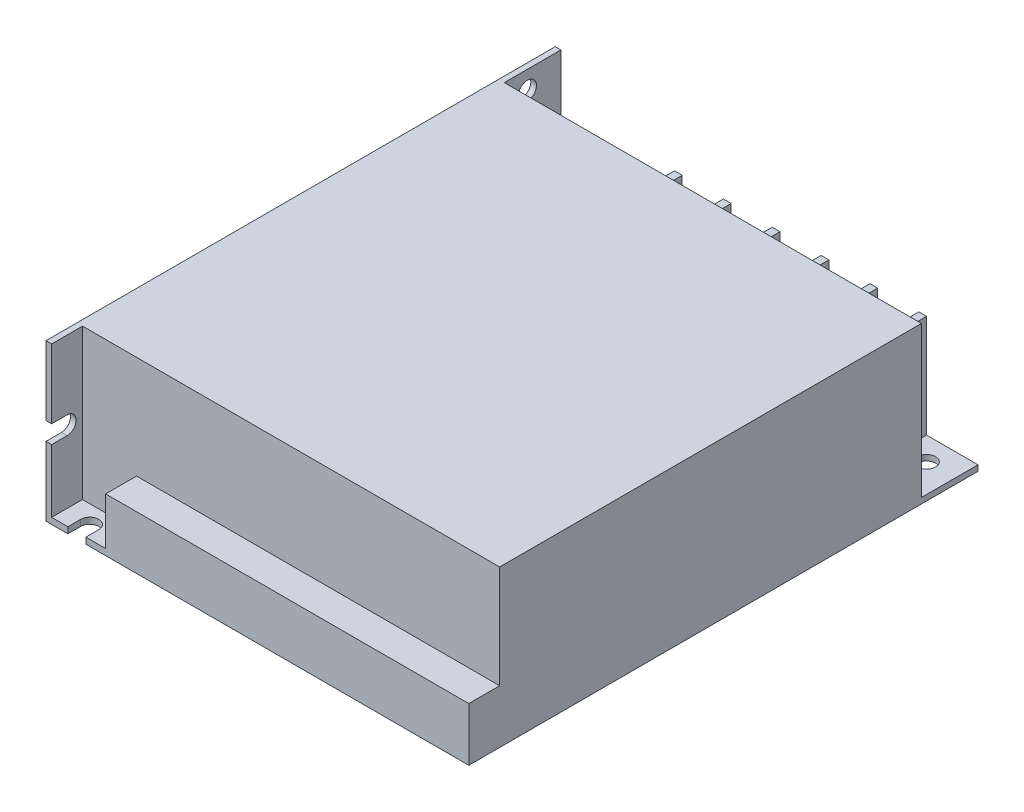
ISO-10303-21;
HEADER;
FILE_DESCRIPTION(('STEP AP214'),'2;1');
FILE_NAME('part.step','',(''),(''),'','','');
FILE_SCHEMA(('AUTOMOTIVE_DESIGN { 1 0 10303 214 1 1 1 1 }'));
ENDSEC;
DATA;
#1=APPLICATION_CONTEXT('core data for automotive mechanical design processes');
#2=APPLICATION_PROTOCOL_DEFINITION('international standard','automotive_design',2000,#1);
#3=PRODUCT_CONTEXT('',#1,'mechanical');
#4=PRODUCT('Part','Part','',(#3));
#5=PRODUCT_RELATED_PRODUCT_CATEGORY('part','',(#4));
#6=PRODUCT_DEFINITION_FORMATION('','',#4);
#7=PRODUCT_DEFINITION_CONTEXT('part definition',#1,'design');
#8=PRODUCT_DEFINITION('design','',#6,#7);
#9=PRODUCT_DEFINITION_SHAPE('','',#8);
#10=(LENGTH_UNIT() NAMED_UNIT(*) SI_UNIT(.MILLI.,.METRE.));
#11=(NAMED_UNIT(*) PLANE_ANGLE_UNIT() SI_UNIT($,.RADIAN.));
#12=(NAMED_UNIT(*) SI_UNIT($,.STERADIAN.) SOLID_ANGLE_UNIT());
#13=UNCERTAINTY_MEASURE_WITH_UNIT(LENGTH_MEASURE(1.E-05),#10,'distance_accuracy_value','');
#14=(GEOMETRIC_REPRESENTATION_CONTEXT(3) GLOBAL_UNCERTAINTY_ASSIGNED_CONTEXT((#13)) GLOBAL_UNIT_ASSIGNED_CONTEXT((#10,
#11,#12)) REPRESENTATION_CONTEXT('',''));
#15=CARTESIAN_POINT('',(0.,0.,0.));
#16=DIRECTION('',(0.,0.,1.));
#17=DIRECTION('',(1.,0.,0.));
#18=AXIS2_PLACEMENT_3D('',#15,#16,#17);
#19=CARTESIAN_POINT('',(0.,30.4,0.));
#20=DIRECTION('',(0.,0.,-1.));
#21=DIRECTION('',(-1.,0.,0.));
#22=AXIS2_PLACEMENT_3D('',#19,#20,#21);
#23=PLANE('',#22);
#24=DIRECTION('',(1.,0.,0.));
#25=VECTOR('',#24,1.);
#26=CARTESIAN_POINT('',(0.,0.,0.));
#27=LINE('',#26,#25);
#28=CARTESIAN_POINT('',(0.,0.,0.));
#29=VERTEX_POINT('',#28);
#30=CARTESIAN_POINT('',(4.25,0.,0.));
#31=VERTEX_POINT('',#30);
#32=EDGE_CURVE('E677',#29,#31,#27,.T.);
#33=ORIENTED_EDGE('',*,*,#32,.T.);
#34=DIRECTION('',(0.,-1.,0.));
#35=VECTOR('',#34,1.);
#36=CARTESIAN_POINT('',(4.25,30.4,0.));
#37=LINE('',#36,#35);
#38=CARTESIAN_POINT('',(4.25,1.20000000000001,0.));
#39=VERTEX_POINT('',#38);
#40=EDGE_CURVE('E361',#39,#31,#37,.T.);
#41=ORIENTED_EDGE('',*,*,#40,.F.);
#42=DIRECTION('',(1.,0.,0.));
#43=VECTOR('',#42,1.);
#44=CARTESIAN_POINT('',(1.1,1.2,0.));
#45=LINE('',#44,#43);
#46=CARTESIAN_POINT('',(1.1,1.2,0.));
#47=VERTEX_POINT('',#46);
#48=EDGE_CURVE('E368',#47,#39,#45,.T.);
#49=ORIENTED_EDGE('',*,*,#48,.F.);
#50=DIRECTION('',(0.,1.,0.));
#51=VECTOR('',#50,1.);
#52=CARTESIAN_POINT('',(1.1,10.4,0.));
#53=LINE('',#52,#51);
#54=CARTESIAN_POINT('',(1.1,13.45,0.));
#55=VERTEX_POINT('',#54);
#56=EDGE_CURVE('E654',#47,#55,#53,.T.);
#57=ORIENTED_EDGE('',*,*,#56,.T.);
#58=DIRECTION('',(-1.,0.,0.));
#59=VECTOR('',#58,1.);
#60=CARTESIAN_POINT('',(3.,13.45,0.));
#61=LINE('',#60,#59);
#62=CARTESIAN_POINT('',(0.,13.45,0.));
#63=VERTEX_POINT('',#62);
#64=EDGE_CURVE('E587',#55,#63,#61,.T.);
#65=ORIENTED_EDGE('',*,*,#64,.T.);
#66=DIRECTION('',(0.,-1.,0.));
#67=VECTOR('',#66,1.);
#68=CARTESIAN_POINT('',(0.,30.4,0.));
#69=LINE('',#68,#67);
#70=EDGE_CURVE('E691',#63,#29,#69,.T.);
#71=ORIENTED_EDGE('',*,*,#70,.T.);
#72=EDGE_LOOP('',(#33,#41,#49,#57,#65,#71));
#73=FACE_BOUND('',#72,.T.);
#74=ADVANCED_FACE('F39',(#73),#23,.F.);
#75=CARTESIAN_POINT('',(0.,30.4,-99.));
#76=DIRECTION('',(0.,0.,1.));
#77=DIRECTION('',(1.,0.,0.));
#78=AXIS2_PLACEMENT_3D('',#75,#76,#77);
#79=PLANE('',#78);
#80=DIRECTION('',(0.,1.,0.));
#81=VECTOR('',#80,1.);
#82=CARTESIAN_POINT('',(70.7,13.1,-99.));
#83=LINE('',#82,#81);
#84=CARTESIAN_POINT('',(70.7,13.1,-99.));
#85=VERTEX_POINT('',#84);
#86=CARTESIAN_POINT('',(70.7,21.1,-99.));
#87=VERTEX_POINT('',#86);
#88=EDGE_CURVE('E413',#85,#87,#83,.T.);
#89=ORIENTED_EDGE('',*,*,#88,.T.);
#90=DIRECTION('',(-1.,0.,0.));
#91=VECTOR('',#90,1.);
#92=CARTESIAN_POINT('',(72.2,21.1,-99.));
#93=LINE('',#92,#91);
#94=CARTESIAN_POINT('',(72.2,21.1,-99.));
#95=VERTEX_POINT('',#94);
#96=EDGE_CURVE('E543',#95,#87,#93,.T.);
#97=ORIENTED_EDGE('',*,*,#96,.F.);
#98=DIRECTION('',(0.,-1.,0.));
#99=VECTOR('',#98,1.);
#100=CARTESIAN_POINT('',(72.2,21.1,-99.));
#101=LINE('',#100,#99);
#102=CARTESIAN_POINT('',(72.2,1.1,-99.));
#103=VERTEX_POINT('',#102);
#104=EDGE_CURVE('E566',#95,#103,#101,.T.);
#105=ORIENTED_EDGE('',*,*,#104,.T.);
#106=DIRECTION('',(-1.,0.,0.));
#107=VECTOR('',#106,1.);
#108=CARTESIAN_POINT('',(82.2,1.1,-99.));
#109=LINE('',#108,#107);
#110=CARTESIAN_POINT('',(82.2,1.1,-99.));
#111=VERTEX_POINT('',#110);
#112=EDGE_CURVE('E607',#111,#103,#109,.T.);
#113=ORIENTED_EDGE('',*,*,#112,.F.);
#114=DIRECTION('',(0.,-1.,0.));
#115=VECTOR('',#114,1.);
#116=CARTESIAN_POINT('',(82.2,30.4,-99.));
#117=LINE('',#116,#115);
#118=CARTESIAN_POINT('',(82.2,0.,-99.));
#119=VERTEX_POINT('',#118);
#120=EDGE_CURVE('E686',#111,#119,#117,.T.);
#121=ORIENTED_EDGE('',*,*,#120,.T.);
#122=DIRECTION('',(-1.,0.,0.));
#123=VECTOR('',#122,1.);
#124=CARTESIAN_POINT('',(0.,0.,-99.));
#125=LINE('',#124,#123);
#126=CARTESIAN_POINT('',(0.,0.,-99.));
#127=VERTEX_POINT('',#126);
#128=EDGE_CURVE('E666',#119,#127,#125,.T.);
#129=ORIENTED_EDGE('',*,*,#128,.T.);
#130=DIRECTION('',(0.,-1.,0.));
#131=VECTOR('',#130,1.);
#132=CARTESIAN_POINT('',(0.,30.4,-99.));
#133=LINE('',#132,#131);
#134=CARTESIAN_POINT('',(0.,30.4,-99.));
#135=VERTEX_POINT('',#134);
#136=EDGE_CURVE('E674',#135,#127,#133,.T.);
#137=ORIENTED_EDGE('',*,*,#136,.F.);
#138=DIRECTION('',(-1.,0.,0.));
#139=VECTOR('',#138,1.);
#140=CARTESIAN_POINT('',(0.,30.4,-99.));
#141=LINE('',#140,#139);
#142=CARTESIAN_POINT('',(1.1,30.4,-99.));
#143=VERTEX_POINT('',#142);
#144=EDGE_CURVE('E672',#143,#135,#141,.T.);
#145=ORIENTED_EDGE('',*,*,#144,.F.);
#146=DIRECTION('',(0.,1.,0.));
#147=VECTOR('',#146,1.);
#148=CARTESIAN_POINT('',(1.1,1.1,-99.));
#149=LINE('',#148,#147);
#150=CARTESIAN_POINT('',(1.1,6.6,-99.));
#151=VERTEX_POINT('',#150);
#152=EDGE_CURVE('E612',#151,#143,#149,.T.);
#153=ORIENTED_EDGE('',*,*,#152,.F.);
#154=DIRECTION('',(-1.,0.,0.));
#155=VECTOR('',#154,1.);
#156=CARTESIAN_POINT('',(1.1,6.6,-99.));
#157=LINE('',#156,#155);
#158=CARTESIAN_POINT('',(23.2,6.6,-99.));
#159=VERTEX_POINT('',#158);
#160=EDGE_CURVE('E536',#159,#151,#157,.T.);
#161=ORIENTED_EDGE('',*,*,#160,.F.);
#162=DIRECTION('',(0.,-1.,0.));
#163=VECTOR('',#162,1.);
#164=CARTESIAN_POINT('',(23.2,21.1,-99.));
#165=LINE('',#164,#163);
#166=CARTESIAN_POINT('',(23.2,21.1,-99.));
#167=VERTEX_POINT('',#166);
#168=EDGE_CURVE('E563',#167,#159,#165,.T.);
#169=ORIENTED_EDGE('',*,*,#168,.F.);
#170=CARTESIAN_POINT('',(24.7,21.1,-99.));
#171=VERTEX_POINT('',#170);
#172=EDGE_CURVE('E542',#171,#167,#93,.T.);
#173=ORIENTED_EDGE('',*,*,#172,.F.);
#174=DIRECTION('',(0.,1.,0.));
#175=VECTOR('',#174,1.);
#176=CARTESIAN_POINT('',(24.7,13.1,-99.));
#177=LINE('',#176,#175);
#178=CARTESIAN_POINT('',(24.7,13.1,-99.));
#179=VERTEX_POINT('',#178);
#180=EDGE_CURVE('E527',#179,#171,#177,.T.);
#181=ORIENTED_EDGE('',*,*,#180,.F.);
#182=DIRECTION('',(-1.,0.,0.));
#183=VECTOR('',#182,1.);
#184=CARTESIAN_POINT('',(0.,13.1,-99.));
#185=LINE('',#184,#183);
#186=CARTESIAN_POINT('',(32.7,13.1,-99.));
#187=VERTEX_POINT('',#186);
#188=EDGE_CURVE('E509',#187,#179,#185,.T.);
#189=ORIENTED_EDGE('',*,*,#188,.F.);
#190=DIRECTION('',(0.,1.,0.));
#191=VECTOR('',#190,1.);
#192=CARTESIAN_POINT('',(32.7,13.1,-99.));
#193=LINE('',#192,#191);
#194=CARTESIAN_POINT('',(32.7,21.1,-99.));
#195=VERTEX_POINT('',#194);
#196=EDGE_CURVE('E519',#187,#195,#193,.T.);
#197=ORIENTED_EDGE('',*,*,#196,.T.);
#198=CARTESIAN_POINT('',(34.2,21.1,-99.));
#199=VERTEX_POINT('',#198);
#200=EDGE_CURVE('E824',#199,#195,#93,.T.);
#201=ORIENTED_EDGE('',*,*,#200,.F.);
#202=DIRECTION('',(0.,1.,0.));
#203=VECTOR('',#202,1.);
#204=CARTESIAN_POINT('',(34.2,13.1,-99.));
#205=LINE('',#204,#203);
#206=CARTESIAN_POINT('',(34.2,13.1,-99.));
#207=VERTEX_POINT('',#206);
#208=EDGE_CURVE('E503',#207,#199,#205,.T.);
#209=ORIENTED_EDGE('',*,*,#208,.F.);
#210=DIRECTION('',(-1.,0.,0.));
#211=VECTOR('',#210,1.);
#212=CARTESIAN_POINT('',(0.,13.1,-99.));
#213=LINE('',#212,#211);
#214=CARTESIAN_POINT('',(42.2,13.1,-99.));
#215=VERTEX_POINT('',#214);
#216=EDGE_CURVE('E483',#215,#207,#213,.T.);
#217=ORIENTED_EDGE('',*,*,#216,.F.);
#218=DIRECTION('',(0.,1.,0.));
#219=VECTOR('',#218,1.);
#220=CARTESIAN_POINT('',(42.2,13.1,-99.));
#221=LINE('',#220,#219);
#222=CARTESIAN_POINT('',(42.2,21.1,-99.));
#223=VERTEX_POINT('',#222);
#224=EDGE_CURVE('E493',#215,#223,#221,.T.);
#225=ORIENTED_EDGE('',*,*,#224,.T.);
#226=CARTESIAN_POINT('',(43.7,21.1,-99.));
#227=VERTEX_POINT('',#226);
#228=EDGE_CURVE('E826',#227,#223,#93,.T.);
#229=ORIENTED_EDGE('',*,*,#228,.F.);
#230=DIRECTION('',(0.,1.,0.));
#231=VECTOR('',#230,1.);
#232=CARTESIAN_POINT('',(43.7,13.1,-99.));
#233=LINE('',#232,#231);
#234=CARTESIAN_POINT('',(43.7,13.1,-99.));
#235=VERTEX_POINT('',#234);
#236=EDGE_CURVE('E477',#235,#227,#233,.T.);
#237=ORIENTED_EDGE('',*,*,#236,.F.);
#238=DIRECTION('',(-1.,0.,0.));
#239=VECTOR('',#238,1.);
#240=CARTESIAN_POINT('',(0.,13.1,-99.));
#241=LINE('',#240,#239);
#242=CARTESIAN_POINT('',(51.7,13.1,-99.));
#243=VERTEX_POINT('',#242);
#244=EDGE_CURVE('E457',#243,#235,#241,.T.);
#245=ORIENTED_EDGE('',*,*,#244,.F.);
#246=DIRECTION('',(0.,1.,0.));
#247=VECTOR('',#246,1.);
#248=CARTESIAN_POINT('',(51.7,13.1,-99.));
#249=LINE('',#248,#247);
#250=CARTESIAN_POINT('',(51.7,21.1,-99.));
#251=VERTEX_POINT('',#250);
#252=EDGE_CURVE('E467',#243,#251,#249,.T.);
#253=ORIENTED_EDGE('',*,*,#252,.T.);
#254=CARTESIAN_POINT('',(53.2,21.1,-99.));
#255=VERTEX_POINT('',#254);
#256=EDGE_CURVE('E831',#255,#251,#93,.T.);
#257=ORIENTED_EDGE('',*,*,#256,.F.);
#258=DIRECTION('',(0.,1.,0.));
#259=VECTOR('',#258,1.);
#260=CARTESIAN_POINT('',(53.2,13.1,-99.));
#261=LINE('',#260,#259);
#262=CARTESIAN_POINT('',(53.2,13.1,-99.));
#263=VERTEX_POINT('',#262);
#264=EDGE_CURVE('E451',#263,#255,#261,.T.);
#265=ORIENTED_EDGE('',*,*,#264,.F.);
#266=DIRECTION('',(-1.,0.,0.));
#267=VECTOR('',#266,1.);
#268=CARTESIAN_POINT('',(0.,13.1,-99.));
#269=LINE('',#268,#267);
#270=CARTESIAN_POINT('',(61.2,13.1,-99.));
#271=VERTEX_POINT('',#270);
#272=EDGE_CURVE('E431',#271,#263,#269,.T.);
#273=ORIENTED_EDGE('',*,*,#272,.F.);
#274=DIRECTION('',(0.,1.,0.));
#275=VECTOR('',#274,1.);
#276=CARTESIAN_POINT('',(61.2,13.1,-99.));
#277=LINE('',#276,#275);
#278=CARTESIAN_POINT('',(61.2,21.1,-99.));
#279=VERTEX_POINT('',#278);
#280=EDGE_CURVE('E441',#271,#279,#277,.T.);
#281=ORIENTED_EDGE('',*,*,#280,.T.);
#282=CARTESIAN_POINT('',(62.7,21.1,-99.));
#283=VERTEX_POINT('',#282);
#284=EDGE_CURVE('E547',#283,#279,#93,.T.);
#285=ORIENTED_EDGE('',*,*,#284,.F.);
#286=DIRECTION('',(0.,1.,0.));
#287=VECTOR('',#286,1.);
#288=CARTESIAN_POINT('',(62.7,13.1,-99.));
#289=LINE('',#288,#287);
#290=CARTESIAN_POINT('',(62.7,13.1,-99.));
#291=VERTEX_POINT('',#290);
#292=EDGE_CURVE('E425',#291,#283,#289,.T.);
#293=ORIENTED_EDGE('',*,*,#292,.F.);
#294=DIRECTION('',(-1.,0.,0.));
#295=VECTOR('',#294,1.);
#296=CARTESIAN_POINT('',(0.,13.1,-99.));
#297=LINE('',#296,#295);
#298=EDGE_CURVE('E403',#85,#291,#297,.T.);
#299=ORIENTED_EDGE('',*,*,#298,.F.);
#300=EDGE_LOOP('',(#89,#97,#105,#113,#121,#129,#137,#145,#153,#161,#169,#173,#181,#189,#197,
#201,#209,#217,#225,#229,#237,#245,#253,#257,#265,#273,#281,#285,#293,#299));
#301=FACE_BOUND('',#300,.T.);
#302=ADVANCED_FACE('F762',(#301),#79,.F.);
#303=CARTESIAN_POINT('',(0.,21.1,0.));
#304=DIRECTION('',(0.,-1.,0.));
#305=DIRECTION('',(0.,0.,-1.));
#306=AXIS2_PLACEMENT_3D('',#303,#304,#305);
#307=PLANE('',#306);
#308=DIRECTION('',(0.,0.,1.));
#309=VECTOR('',#308,1.);
#310=CARTESIAN_POINT('',(70.7,21.1,0.));
#311=LINE('',#310,#309);
#312=CARTESIAN_POINT('',(70.7,21.1,-88.));
#313=VERTEX_POINT('',#312);
#314=EDGE_CURVE('E414',#87,#313,#311,.T.);
#315=ORIENTED_EDGE('',*,*,#314,.T.);
#316=DIRECTION('',(1.,0.,0.));
#317=VECTOR('',#316,1.);
#318=CARTESIAN_POINT('',(72.2,21.1,-88.));
#319=LINE('',#318,#317);
#320=CARTESIAN_POINT('',(72.2,21.1,-88.));
#321=VERTEX_POINT('',#320);
#322=EDGE_CURVE('E550',#313,#321,#319,.T.);
#323=ORIENTED_EDGE('',*,*,#322,.T.);
#324=DIRECTION('',(0.,0.,-1.));
#325=VECTOR('',#324,1.);
#326=CARTESIAN_POINT('',(72.2,21.1,-99.));
#327=LINE('',#326,#325);
#328=EDGE_CURVE('E539',#321,#95,#327,.T.);
#329=ORIENTED_EDGE('',*,*,#328,.T.);
#330=ORIENTED_EDGE('',*,*,#96,.T.);
#331=EDGE_LOOP('',(#315,#323,#329,#330));
#332=FACE_BOUND('',#331,.T.);
#333=ADVANCED_FACE('F866',(#332),#307,.F.);
#334=CARTESIAN_POINT('',(61.2,21.1,-88.));
#335=VERTEX_POINT('',#334);
#336=CARTESIAN_POINT('',(62.7,21.1,-88.));
#337=VERTEX_POINT('',#336);
#338=EDGE_CURVE('E858',#335,#337,#319,.T.);
#339=ORIENTED_EDGE('',*,*,#338,.T.);
#340=DIRECTION('',(0.,0.,1.));
#341=VECTOR('',#340,1.);
#342=CARTESIAN_POINT('',(62.7,21.1,0.));
#343=LINE('',#342,#341);
#344=EDGE_CURVE('E404',#283,#337,#343,.T.);
#345=ORIENTED_EDGE('',*,*,#344,.F.);
#346=ORIENTED_EDGE('',*,*,#284,.T.);
#347=DIRECTION('',(0.,0.,1.));
#348=VECTOR('',#347,1.);
#349=CARTESIAN_POINT('',(61.2,21.1,0.));
#350=LINE('',#349,#348);
#351=EDGE_CURVE('E442',#279,#335,#350,.T.);
#352=ORIENTED_EDGE('',*,*,#351,.T.);
#353=EDGE_LOOP('',(#339,#345,#346,#352));
#354=FACE_BOUND('',#353,.T.);
#355=ADVANCED_FACE('F844',(#354),#307,.F.);
#356=CARTESIAN_POINT('',(51.7,21.1,-88.));
#357=VERTEX_POINT('',#356);
#358=CARTESIAN_POINT('',(53.2,21.1,-88.));
#359=VERTEX_POINT('',#358);
#360=EDGE_CURVE('E860',#357,#359,#319,.T.);
#361=ORIENTED_EDGE('',*,*,#360,.T.);
#362=DIRECTION('',(0.,0.,1.));
#363=VECTOR('',#362,1.);
#364=CARTESIAN_POINT('',(53.2,21.1,0.));
#365=LINE('',#364,#363);
#366=EDGE_CURVE('E432',#255,#359,#365,.T.);
#367=ORIENTED_EDGE('',*,*,#366,.F.);
#368=ORIENTED_EDGE('',*,*,#256,.T.);
#369=DIRECTION('',(0.,0.,1.));
#370=VECTOR('',#369,1.);
#371=CARTESIAN_POINT('',(51.7,21.1,0.));
#372=LINE('',#371,#370);
#373=EDGE_CURVE('E468',#251,#357,#372,.T.);
#374=ORIENTED_EDGE('',*,*,#373,.T.);
#375=EDGE_LOOP('',(#361,#367,#368,#374));
#376=FACE_BOUND('',#375,.T.);
#377=ADVANCED_FACE('F1420',(#376),#307,.F.);
#378=CARTESIAN_POINT('',(42.2,21.1,-88.));
#379=VERTEX_POINT('',#378);
#380=CARTESIAN_POINT('',(43.7,21.1,-88.));
#381=VERTEX_POINT('',#380);
#382=EDGE_CURVE('E862',#379,#381,#319,.T.);
#383=ORIENTED_EDGE('',*,*,#382,.T.);
#384=DIRECTION('',(0.,0.,1.));
#385=VECTOR('',#384,1.);
#386=CARTESIAN_POINT('',(43.7,21.1,0.));
#387=LINE('',#386,#385);
#388=EDGE_CURVE('E458',#227,#381,#387,.T.);
#389=ORIENTED_EDGE('',*,*,#388,.F.);
#390=ORIENTED_EDGE('',*,*,#228,.T.);
#391=DIRECTION('',(0.,0.,1.));
#392=VECTOR('',#391,1.);
#393=CARTESIAN_POINT('',(42.2,21.1,0.));
#394=LINE('',#393,#392);
#395=EDGE_CURVE('E494',#223,#379,#394,.T.);
#396=ORIENTED_EDGE('',*,*,#395,.T.);
#397=EDGE_LOOP('',(#383,#389,#390,#396));
#398=FACE_BOUND('',#397,.T.);
#399=ADVANCED_FACE('F1413',(#398),#307,.F.);
#400=CARTESIAN_POINT('',(32.7,21.1,-88.));
#401=VERTEX_POINT('',#400);
#402=CARTESIAN_POINT('',(34.2,21.1,-88.));
#403=VERTEX_POINT('',#402);
#404=EDGE_CURVE('E555',#401,#403,#319,.T.);
#405=ORIENTED_EDGE('',*,*,#404,.T.);
#406=DIRECTION('',(0.,0.,1.));
#407=VECTOR('',#406,1.);
#408=CARTESIAN_POINT('',(34.2,21.1,0.));
#409=LINE('',#408,#407);
#410=EDGE_CURVE('E484',#199,#403,#409,.T.);
#411=ORIENTED_EDGE('',*,*,#410,.F.);
#412=ORIENTED_EDGE('',*,*,#200,.T.);
#413=DIRECTION('',(0.,0.,1.));
#414=VECTOR('',#413,1.);
#415=CARTESIAN_POINT('',(32.7,21.1,0.));
#416=LINE('',#415,#414);
#417=EDGE_CURVE('E400',#195,#401,#416,.T.);
#418=ORIENTED_EDGE('',*,*,#417,.T.);
#419=EDGE_LOOP('',(#405,#411,#412,#418));
#420=FACE_BOUND('',#419,.T.);
#421=ADVANCED_FACE('F1234',(#420),#307,.F.);
#422=CARTESIAN_POINT('',(0.,1.1,0.));
#423=DIRECTION('',(0.,-1.,0.));
#424=DIRECTION('',(0.,0.,-1.));
#425=AXIS2_PLACEMENT_3D('',#422,#423,#424);
#426=PLANE('',#425);
#427=CARTESIAN_POINT('',(76.7,1.1,-94.5));
#428=DIRECTION('',(0.,-1.,0.));
#429=DIRECTION('',(0.,0.,-1.));
#430=AXIS2_PLACEMENT_3D('',#427,#428,#429);
#431=CIRCLE('',#430,1.75);
#432=CARTESIAN_POINT('',(76.7,1.1,-96.25));
#433=VERTEX_POINT('',#432);
#434=EDGE_CURVE('E619',#433,#433,#431,.F.);
#435=ORIENTED_EDGE('',*,*,#434,.F.);
#436=EDGE_LOOP('',(#435));
#437=FACE_BOUND('',#436,.T.);
#438=DIRECTION('',(0.,0.,-1.));
#439=VECTOR('',#438,1.);
#440=CARTESIAN_POINT('',(72.2,1.1,-99.));
#441=LINE('',#440,#439);
#442=CARTESIAN_POINT('',(72.2,1.1,-88.));
#443=VERTEX_POINT('',#442);
#444=EDGE_CURVE('E538',#443,#103,#441,.T.);
#445=ORIENTED_EDGE('',*,*,#444,.F.);
#446=DIRECTION('',(1.,0.,0.));
#447=VECTOR('',#446,1.);
#448=CARTESIAN_POINT('',(82.2,1.1,-88.));
#449=LINE('',#448,#447);
#450=CARTESIAN_POINT('',(82.2,1.1,-88.));
#451=VERTEX_POINT('',#450);
#452=EDGE_CURVE('E610',#443,#451,#449,.T.);
#453=ORIENTED_EDGE('',*,*,#452,.T.);
#454=DIRECTION('',(0.,0.,-1.));
#455=VECTOR('',#454,1.);
#456=CARTESIAN_POINT('',(82.2,1.1,-99.));
#457=LINE('',#456,#455);
#458=EDGE_CURVE('E605',#451,#111,#457,.T.);
#459=ORIENTED_EDGE('',*,*,#458,.T.);
#460=ORIENTED_EDGE('',*,*,#112,.T.);
#461=EDGE_LOOP('',(#445,#453,#459,#460));
#462=FACE_BOUND('',#461,.T.);
#463=ADVANCED_FACE('F1231',(#437,#462),#426,.F.);
#464=CARTESIAN_POINT('',(82.2,1.1,-88.));
#465=DIRECTION('',(0.,0.,1.));
#466=DIRECTION('',(1.,0.,0.));
#467=AXIS2_PLACEMENT_3D('',#464,#465,#466);
#468=PLANE('',#467);
#469=DIRECTION('',(0.,-1.,0.));
#470=VECTOR('',#469,1.);
#471=CARTESIAN_POINT('',(23.2,21.1,-88.));
#472=LINE('',#471,#470);
#473=CARTESIAN_POINT('',(23.2,21.1,-88.));
#474=VERTEX_POINT('',#473);
#475=CARTESIAN_POINT('',(23.2,6.6,-88.));
#476=VERTEX_POINT('',#475);
#477=EDGE_CURVE('E560',#474,#476,#472,.T.);
#478=ORIENTED_EDGE('',*,*,#477,.T.);
#479=DIRECTION('',(1.,0.,0.));
#480=VECTOR('',#479,1.);
#481=CARTESIAN_POINT('',(1.1,6.6,-88.));
#482=LINE('',#481,#480);
#483=CARTESIAN_POINT('',(1.1,6.6,-88.));
#484=VERTEX_POINT('',#483);
#485=EDGE_CURVE('E532',#484,#476,#482,.T.);
#486=ORIENTED_EDGE('',*,*,#485,.F.);
#487=DIRECTION('',(0.,1.,0.));
#488=VECTOR('',#487,1.);
#489=CARTESIAN_POINT('',(1.1,1.1,-88.));
#490=LINE('',#489,#488);
#491=CARTESIAN_POINT('',(1.1,13.7638593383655,-88.));
#492=VERTEX_POINT('',#491);
#493=EDGE_CURVE('E620',#484,#492,#490,.T.);
#494=ORIENTED_EDGE('',*,*,#493,.T.);
#495=DIRECTION('',(-1.,0.,0.));
#496=VECTOR('',#495,1.);
#497=CARTESIAN_POINT('',(3.,13.7638593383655,-88.));
#498=LINE('',#497,#496);
#499=CARTESIAN_POINT('',(3.,13.7638593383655,-88.));
#500=VERTEX_POINT('',#499);
#501=EDGE_CURVE('E573',#492,#500,#498,.F.);
#502=ORIENTED_EDGE('',*,*,#501,.T.);
#503=DIRECTION('',(0.,-1.,0.));
#504=VECTOR('',#503,1.);
#505=CARTESIAN_POINT('',(3.,1.1,-88.));
#506=LINE('',#505,#504);
#507=CARTESIAN_POINT('',(3.,16.6361406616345,-88.));
#508=VERTEX_POINT('',#507);
#509=EDGE_CURVE('E700',#508,#500,#506,.T.);
#510=ORIENTED_EDGE('',*,*,#509,.F.);
#511=DIRECTION('',(-1.,0.,0.));
#512=VECTOR('',#511,1.);
#513=CARTESIAN_POINT('',(3.,16.6361406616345,-88.));
#514=LINE('',#513,#512);
#515=CARTESIAN_POINT('',(1.1,16.6361406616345,-88.));
#516=VERTEX_POINT('',#515);
#517=EDGE_CURVE('E601',#508,#516,#514,.T.);
#518=ORIENTED_EDGE('',*,*,#517,.T.);
#519=CARTESIAN_POINT('',(1.1,30.4,-88.));
#520=VERTEX_POINT('',#519);
#521=EDGE_CURVE('E622',#516,#520,#490,.T.);
#522=ORIENTED_EDGE('',*,*,#521,.T.);
#523=DIRECTION('',(1.,0.,0.));
#524=VECTOR('',#523,1.);
#525=CARTESIAN_POINT('',(82.2,30.4,-88.));
#526=LINE('',#525,#524);
#527=CARTESIAN_POINT('',(82.2,30.4,-88.));
#528=VERTEX_POINT('',#527);
#529=EDGE_CURVE('E608',#520,#528,#526,.T.);
#530=ORIENTED_EDGE('',*,*,#529,.T.);
#531=DIRECTION('',(0.,1.,0.));
#532=VECTOR('',#531,1.);
#533=CARTESIAN_POINT('',(82.2,1.1,-88.));
#534=LINE('',#533,#532);
#535=EDGE_CURVE('E616',#451,#528,#534,.T.);
#536=ORIENTED_EDGE('',*,*,#535,.F.);
#537=ORIENTED_EDGE('',*,*,#452,.F.);
#538=DIRECTION('',(0.,-1.,0.));
#539=VECTOR('',#538,1.);
#540=CARTESIAN_POINT('',(72.2,21.1,-88.));
#541=LINE('',#540,#539);
#542=EDGE_CURVE('E554',#321,#443,#541,.T.);
#543=ORIENTED_EDGE('',*,*,#542,.F.);
#544=ORIENTED_EDGE('',*,*,#322,.F.);
#545=DIRECTION('',(0.,1.,0.));
#546=VECTOR('',#545,1.);
#547=CARTESIAN_POINT('',(70.7,13.1,-88.));
#548=LINE('',#547,#546);
#549=CARTESIAN_POINT('',(70.7,13.1,-88.));
#550=VERTEX_POINT('',#549);
#551=EDGE_CURVE('E420',#550,#313,#548,.T.);
#552=ORIENTED_EDGE('',*,*,#551,.F.);
#553=DIRECTION('',(1.,0.,0.));
#554=VECTOR('',#553,1.);
#555=CARTESIAN_POINT('',(0.,13.1,-88.));
#556=LINE('',#555,#554);
#557=CARTESIAN_POINT('',(62.7,13.1,-88.));
#558=VERTEX_POINT('',#557);
#559=EDGE_CURVE('E410',#558,#550,#556,.T.);
#560=ORIENTED_EDGE('',*,*,#559,.F.);
#561=DIRECTION('',(0.,1.,0.));
#562=VECTOR('',#561,1.);
#563=CARTESIAN_POINT('',(62.7,13.1,-88.));
#564=LINE('',#563,#562);
#565=EDGE_CURVE('E423',#558,#337,#564,.T.);
#566=ORIENTED_EDGE('',*,*,#565,.T.);
#567=ORIENTED_EDGE('',*,*,#338,.F.);
#568=DIRECTION('',(0.,1.,0.));
#569=VECTOR('',#568,1.);
#570=CARTESIAN_POINT('',(61.2,13.1,-88.));
#571=LINE('',#570,#569);
#572=CARTESIAN_POINT('',(61.2,13.1,-88.));
#573=VERTEX_POINT('',#572);
#574=EDGE_CURVE('E417',#573,#335,#571,.T.);
#575=ORIENTED_EDGE('',*,*,#574,.F.);
#576=DIRECTION('',(1.,0.,0.));
#577=VECTOR('',#576,1.);
#578=CARTESIAN_POINT('',(0.,13.1,-88.));
#579=LINE('',#578,#577);
#580=CARTESIAN_POINT('',(53.2,13.1,-88.));
#581=VERTEX_POINT('',#580);
#582=EDGE_CURVE('E438',#581,#573,#579,.T.);
#583=ORIENTED_EDGE('',*,*,#582,.F.);
#584=DIRECTION('',(0.,1.,0.));
#585=VECTOR('',#584,1.);
#586=CARTESIAN_POINT('',(53.2,13.1,-88.));
#587=LINE('',#586,#585);
#588=EDGE_CURVE('E449',#581,#359,#587,.T.);
#589=ORIENTED_EDGE('',*,*,#588,.T.);
#590=ORIENTED_EDGE('',*,*,#360,.F.);
#591=DIRECTION('',(0.,1.,0.));
#592=VECTOR('',#591,1.);
#593=CARTESIAN_POINT('',(51.7,13.1,-88.));
#594=LINE('',#593,#592);
#595=CARTESIAN_POINT('',(51.7,13.1,-88.));
#596=VERTEX_POINT('',#595);
#597=EDGE_CURVE('E445',#596,#357,#594,.T.);
#598=ORIENTED_EDGE('',*,*,#597,.F.);
#599=DIRECTION('',(1.,0.,0.));
#600=VECTOR('',#599,1.);
#601=CARTESIAN_POINT('',(0.,13.1,-88.));
#602=LINE('',#601,#600);
#603=CARTESIAN_POINT('',(43.7,13.1,-88.));
#604=VERTEX_POINT('',#603);
#605=EDGE_CURVE('E464',#604,#596,#602,.T.);
#606=ORIENTED_EDGE('',*,*,#605,.F.);
#607=DIRECTION('',(0.,1.,0.));
#608=VECTOR('',#607,1.);
#609=CARTESIAN_POINT('',(43.7,13.1,-88.));
#610=LINE('',#609,#608);
#611=EDGE_CURVE('E475',#604,#381,#610,.T.);
#612=ORIENTED_EDGE('',*,*,#611,.T.);
#613=ORIENTED_EDGE('',*,*,#382,.F.);
#614=DIRECTION('',(0.,1.,0.));
#615=VECTOR('',#614,1.);
#616=CARTESIAN_POINT('',(42.2,13.1,-88.));
#617=LINE('',#616,#615);
#618=CARTESIAN_POINT('',(42.2,13.1,-88.));
#619=VERTEX_POINT('',#618);
#620=EDGE_CURVE('E471',#619,#379,#617,.T.);
#621=ORIENTED_EDGE('',*,*,#620,.F.);
#622=DIRECTION('',(1.,0.,0.));
#623=VECTOR('',#622,1.);
#624=CARTESIAN_POINT('',(0.,13.1,-88.));
#625=LINE('',#624,#623);
#626=CARTESIAN_POINT('',(34.2,13.1,-88.));
#627=VERTEX_POINT('',#626);
#628=EDGE_CURVE('E490',#627,#619,#625,.T.);
#629=ORIENTED_EDGE('',*,*,#628,.F.);
#630=DIRECTION('',(0.,1.,0.));
#631=VECTOR('',#630,1.);
#632=CARTESIAN_POINT('',(34.2,13.1,-88.));
#633=LINE('',#632,#631);
#634=EDGE_CURVE('E501',#627,#403,#633,.T.);
#635=ORIENTED_EDGE('',*,*,#634,.T.);
#636=ORIENTED_EDGE('',*,*,#404,.F.);
#637=DIRECTION('',(0.,1.,0.));
#638=VECTOR('',#637,1.);
#639=CARTESIAN_POINT('',(32.7,13.1,-88.));
#640=LINE('',#639,#638);
#641=CARTESIAN_POINT('',(32.7,13.1,-88.));
#642=VERTEX_POINT('',#641);
#643=EDGE_CURVE('E497',#642,#401,#640,.T.);
#644=ORIENTED_EDGE('',*,*,#643,.F.);
#645=DIRECTION('',(1.,0.,0.));
#646=VECTOR('',#645,1.);
#647=CARTESIAN_POINT('',(0.,13.1,-88.));
#648=LINE('',#647,#646);
#649=CARTESIAN_POINT('',(24.7,13.1,-88.));
#650=VERTEX_POINT('',#649);
#651=EDGE_CURVE('E516',#650,#642,#648,.T.);
#652=ORIENTED_EDGE('',*,*,#651,.F.);
#653=DIRECTION('',(0.,1.,0.));
#654=VECTOR('',#653,1.);
#655=CARTESIAN_POINT('',(24.7,13.1,-88.));
#656=LINE('',#655,#654);
#657=CARTESIAN_POINT('',(24.7,21.1,-88.));
#658=VERTEX_POINT('',#657);
#659=EDGE_CURVE('E525',#650,#658,#656,.T.);
#660=ORIENTED_EDGE('',*,*,#659,.T.);
#661=EDGE_CURVE('E551',#474,#658,#319,.T.);
#662=ORIENTED_EDGE('',*,*,#661,.F.);
#663=EDGE_LOOP('',(#478,#486,#494,#502,#510,#518,#522,#530,#536,#537,#543,#544,#552,#560,#566,
#567,#575,#583,#589,#590,#598,#606,#612,#613,#621,#629,#635,#636,#644,#652,#660,#662));
#664=FACE_BOUND('',#663,.T.);
#665=ADVANCED_FACE('F813',(#664),#468,.F.);
#666=CARTESIAN_POINT('',(0.,30.4,0.));
#667=VERTEX_POINT('',#666);
#668=CARTESIAN_POINT('',(0.,16.95,0.));
#669=VERTEX_POINT('',#668);
#670=EDGE_CURVE('E692',#667,#669,#69,.T.);
#671=ORIENTED_EDGE('',*,*,#670,.T.);
#672=DIRECTION('',(-1.,0.,0.));
#673=VECTOR('',#672,1.);
#674=CARTESIAN_POINT('',(3.,16.95,0.));
#675=LINE('',#674,#673);
#676=CARTESIAN_POINT('',(1.1,16.95,0.));
#677=VERTEX_POINT('',#676);
#678=EDGE_CURVE('E590',#677,#669,#675,.T.);
#679=ORIENTED_EDGE('',*,*,#678,.F.);
#680=CARTESIAN_POINT('',(1.1,30.4,0.));
#681=VERTEX_POINT('',#680);
#682=EDGE_CURVE('E658',#677,#681,#53,.T.);
#683=ORIENTED_EDGE('',*,*,#682,.T.);
#684=DIRECTION('',(1.,0.,0.));
#685=VECTOR('',#684,1.);
#686=CARTESIAN_POINT('',(0.,30.4,0.));
#687=LINE('',#686,#685);
#688=EDGE_CURVE('E665',#667,#681,#687,.T.);
#689=ORIENTED_EDGE('',*,*,#688,.F.);
#690=EDGE_LOOP('',(#671,#679,#683,#689));
#691=FACE_BOUND('',#690,.T.);
#692=ADVANCED_FACE('F794',(#691),#23,.F.);
#693=CARTESIAN_POINT('',(0.,30.4,0.));
#694=DIRECTION('',(1.,0.,0.));
#695=DIRECTION('',(0.,0.,-1.));
#696=AXIS2_PLACEMENT_3D('',#693,#694,#695);
#697=PLANE('',#696);
#698=CARTESIAN_POINT('',(0.,26.8,-92.5));
#699=DIRECTION('',(-1.,0.,0.));
#700=DIRECTION('',(0.,0.,1.));
#701=AXIS2_PLACEMENT_3D('',#698,#699,#700);
#702=CIRCLE('',#701,1.75);
#703=CARTESIAN_POINT('',(0.,26.8,-90.75));
#704=VERTEX_POINT('',#703);
#705=EDGE_CURVE('E380',#704,#704,#702,.T.);
#706=ORIENTED_EDGE('',*,*,#705,.F.);
#707=EDGE_LOOP('',(#706));
#708=FACE_BOUND('',#707,.T.);
#709=CARTESIAN_POINT('',(0.,15.2,-89.));
#710=DIRECTION('',(-1.,0.,0.));
#711=DIRECTION('',(0.,0.,1.));
#712=AXIS2_PLACEMENT_3D('',#709,#710,#711);
#713=CIRCLE('',#712,1.75);
#714=CARTESIAN_POINT('',(0.,15.2,-87.25));
#715=VERTEX_POINT('',#714);
#716=EDGE_CURVE('E574',#715,#715,#713,.T.);
#717=ORIENTED_EDGE('',*,*,#716,.F.);
#718=EDGE_LOOP('',(#717));
#719=FACE_BOUND('',#718,.T.);
#720=CARTESIAN_POINT('',(0.,15.2,-15.));
#721=DIRECTION('',(-1.,0.,0.));
#722=DIRECTION('',(0.,0.,1.));
#723=AXIS2_PLACEMENT_3D('',#720,#721,#722);
#724=CIRCLE('',#723,1.75);
#725=CARTESIAN_POINT('',(0.,15.2,-13.25));
#726=VERTEX_POINT('',#725);
#727=EDGE_CURVE('E577',#726,#726,#724,.T.);
#728=ORIENTED_EDGE('',*,*,#727,.F.);
#729=EDGE_LOOP('',(#728));
#730=FACE_BOUND('',#729,.T.);
#731=CARTESIAN_POINT('',(0.,15.2,-3.));
#732=DIRECTION('',(-1.,0.,0.));
#733=DIRECTION('',(0.,0.,1.));
#734=AXIS2_PLACEMENT_3D('',#731,#732,#733);
#735=CIRCLE('',#734,1.75);
#736=CARTESIAN_POINT('',(0.,16.95,-3.));
#737=VERTEX_POINT('',#736);
#738=CARTESIAN_POINT('',(0.,13.45,-3.));
#739=VERTEX_POINT('',#738);
#740=EDGE_CURVE('E583',#737,#739,#735,.T.);
#741=ORIENTED_EDGE('',*,*,#740,.F.);
#742=DIRECTION('',(0.,0.,-1.));
#743=VECTOR('',#742,1.);
#744=CARTESIAN_POINT('',(0.,16.95,-3.));
#745=LINE('',#744,#743);
#746=EDGE_CURVE('E586',#669,#737,#745,.T.);
#747=ORIENTED_EDGE('',*,*,#746,.F.);
#748=ORIENTED_EDGE('',*,*,#670,.F.);
#749=DIRECTION('',(0.,0.,1.));
#750=VECTOR('',#749,1.);
#751=CARTESIAN_POINT('',(0.,30.4,0.));
#752=LINE('',#751,#750);
#753=EDGE_CURVE('E662',#135,#667,#752,.T.);
#754=ORIENTED_EDGE('',*,*,#753,.F.);
#755=ORIENTED_EDGE('',*,*,#136,.T.);
#756=DIRECTION('',(0.,0.,1.));
#757=VECTOR('',#756,1.);
#758=CARTESIAN_POINT('',(0.,0.,0.));
#759=LINE('',#758,#757);
#760=EDGE_CURVE('E657',#127,#29,#759,.T.);
#761=ORIENTED_EDGE('',*,*,#760,.T.);
#762=ORIENTED_EDGE('',*,*,#70,.F.);
#763=DIRECTION('',(0.,0.,1.));
#764=VECTOR('',#763,1.);
#765=CARTESIAN_POINT('',(0.,13.45,0.));
#766=LINE('',#765,#764);
#767=EDGE_CURVE('E595',#739,#63,#766,.T.);
#768=ORIENTED_EDGE('',*,*,#767,.F.);
#769=EDGE_LOOP('',(#741,#747,#748,#754,#755,#761,#762,#768));
#770=FACE_BOUND('',#769,.T.);
#771=ADVANCED_FACE('F757',(#708,#719,#730,#770),#697,.F.);
#772=CARTESIAN_POINT('',(7.75,1.2,0.));
#773=VERTEX_POINT('',#772);
#774=CARTESIAN_POINT('',(11.6,1.2,0.));
#775=VERTEX_POINT('',#774);
#776=EDGE_CURVE('E367',#773,#775,#45,.T.);
#777=ORIENTED_EDGE('',*,*,#776,.F.);
#778=DIRECTION('',(0.,-1.,0.));
#779=VECTOR('',#778,1.);
#780=CARTESIAN_POINT('',(7.75,30.4,0.));
#781=LINE('',#780,#779);
#782=CARTESIAN_POINT('',(7.75,0.,0.));
#783=VERTEX_POINT('',#782);
#784=EDGE_CURVE('E54',#773,#783,#781,.T.);
#785=ORIENTED_EDGE('',*,*,#784,.T.);
#786=CARTESIAN_POINT('',(82.2,0.,0.));
#787=VERTEX_POINT('',#786);
#788=EDGE_CURVE('E355',#783,#787,#27,.T.);
#789=ORIENTED_EDGE('',*,*,#788,.T.);
#790=DIRECTION('',(0.,-1.,0.));
#791=VECTOR('',#790,1.);
#792=CARTESIAN_POINT('',(82.2,30.4,0.));
#793=LINE('',#792,#791);
#794=CARTESIAN_POINT('',(82.2,10.4,0.));
#795=VERTEX_POINT('',#794);
#796=EDGE_CURVE('E688',#795,#787,#793,.T.);
#797=ORIENTED_EDGE('',*,*,#796,.F.);
#798=DIRECTION('',(1.,0.,0.));
#799=VECTOR('',#798,1.);
#800=CARTESIAN_POINT('',(82.2,10.4,0.));
#801=LINE('',#800,#799);
#802=CARTESIAN_POINT('',(11.6,10.4,0.));
#803=VERTEX_POINT('',#802);
#804=EDGE_CURVE('E647',#803,#795,#801,.T.);
#805=ORIENTED_EDGE('',*,*,#804,.F.);
#806=DIRECTION('',(0.,1.,0.));
#807=VECTOR('',#806,1.);
#808=CARTESIAN_POINT('',(11.6,1.2,0.));
#809=LINE('',#808,#807);
#810=EDGE_CURVE('E62',#775,#803,#809,.T.);
#811=ORIENTED_EDGE('',*,*,#810,.F.);
#812=EDGE_LOOP('',(#777,#785,#789,#797,#805,#811));
#813=FACE_BOUND('',#812,.T.);
#814=ADVANCED_FACE('F774',(#813),#23,.F.);
#815=CARTESIAN_POINT('',(82.2,30.4,0.));
#816=DIRECTION('',(-1.,0.,0.));
#817=DIRECTION('',(0.,0.,1.));
#818=AXIS2_PLACEMENT_3D('',#815,#816,#817);
#819=PLANE('',#818);
#820=ORIENTED_EDGE('',*,*,#458,.F.);
#821=ORIENTED_EDGE('',*,*,#535,.T.);
#822=DIRECTION('',(0.,0.,-1.));
#823=VECTOR('',#822,1.);
#824=CARTESIAN_POINT('',(82.2,30.4,0.));
#825=LINE('',#824,#823);
#826=CARTESIAN_POINT('',(82.2,30.4,-5.99999999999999));
#827=VERTEX_POINT('',#826);
#828=EDGE_CURVE('E669',#827,#528,#825,.T.);
#829=ORIENTED_EDGE('',*,*,#828,.F.);
#830=DIRECTION('',(0.,1.,0.));
#831=VECTOR('',#830,1.);
#832=CARTESIAN_POINT('',(82.2,10.4,-6.));
#833=LINE('',#832,#831);
#834=CARTESIAN_POINT('',(82.2,10.4,-6.));
#835=VERTEX_POINT('',#834);
#836=EDGE_CURVE('E649',#835,#827,#833,.T.);
#837=ORIENTED_EDGE('',*,*,#836,.F.);
#838=DIRECTION('',(0.,0.,-1.));
#839=VECTOR('',#838,1.);
#840=CARTESIAN_POINT('',(82.2,10.4,0.));
#841=LINE('',#840,#839);
#842=EDGE_CURVE('E640',#795,#835,#841,.T.);
#843=ORIENTED_EDGE('',*,*,#842,.F.);
#844=ORIENTED_EDGE('',*,*,#796,.T.);
#845=DIRECTION('',(0.,0.,-1.));
#846=VECTOR('',#845,1.);
#847=CARTESIAN_POINT('',(82.2,0.,0.));
#848=LINE('',#847,#846);
#849=EDGE_CURVE('E680',#787,#119,#848,.T.);
#850=ORIENTED_EDGE('',*,*,#849,.T.);
#851=ORIENTED_EDGE('',*,*,#120,.F.);
#852=EDGE_LOOP('',(#820,#821,#829,#837,#843,#844,#850,#851));
#853=FACE_BOUND('',#852,.T.);
#854=ADVANCED_FACE('F768',(#853),#819,.F.);
#855=CARTESIAN_POINT('',(0.,30.4,0.));
#856=DIRECTION('',(0.,-1.,0.));
#857=DIRECTION('',(0.,0.,-1.));
#858=AXIS2_PLACEMENT_3D('',#855,#856,#857);
#859=PLANE('',#858);
#860=ORIENTED_EDGE('',*,*,#828,.T.);
#861=ORIENTED_EDGE('',*,*,#529,.F.);
#862=DIRECTION('',(0.,0.,1.));
#863=VECTOR('',#862,1.);
#864=CARTESIAN_POINT('',(1.1,30.4,-99.));
#865=LINE('',#864,#863);
#866=EDGE_CURVE('E604',#143,#520,#865,.T.);
#867=ORIENTED_EDGE('',*,*,#866,.F.);
#868=ORIENTED_EDGE('',*,*,#144,.T.);
#869=ORIENTED_EDGE('',*,*,#753,.T.);
#870=ORIENTED_EDGE('',*,*,#688,.T.);
#871=DIRECTION('',(0.,0.,1.));
#872=VECTOR('',#871,1.);
#873=CARTESIAN_POINT('',(1.1,30.4,0.));
#874=LINE('',#873,#872);
#875=CARTESIAN_POINT('',(1.1,30.4,-5.99999999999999));
#876=VERTEX_POINT('',#875);
#877=EDGE_CURVE('E644',#876,#681,#874,.T.);
#878=ORIENTED_EDGE('',*,*,#877,.F.);
#879=DIRECTION('',(-1.,0.,0.));
#880=VECTOR('',#879,1.);
#881=CARTESIAN_POINT('',(82.2,30.4,-6.));
#882=LINE('',#881,#880);
#883=EDGE_CURVE('E631',#827,#876,#882,.T.);
#884=ORIENTED_EDGE('',*,*,#883,.F.);
#885=EDGE_LOOP('',(#860,#861,#867,#868,#869,#870,#878,#884));
#886=FACE_BOUND('',#885,.T.);
#887=ADVANCED_FACE('F797',(#886),#859,.F.);
#888=CARTESIAN_POINT('',(0.,0.,0.));
#889=DIRECTION('',(0.,-1.,0.));
#890=DIRECTION('',(0.,0.,-1.));
#891=AXIS2_PLACEMENT_3D('',#888,#889,#890);
#892=PLANE('',#891);
#893=DIRECTION('',(0.,0.,-1.));
#894=VECTOR('',#893,1.);
#895=CARTESIAN_POINT('',(4.25,0.,0.));
#896=LINE('',#895,#894);
#897=CARTESIAN_POINT('',(4.25,0.,-2.5));
#898=VERTEX_POINT('',#897);
#899=EDGE_CURVE('E340',#31,#898,#896,.T.);
#900=ORIENTED_EDGE('',*,*,#899,.F.);
#901=ORIENTED_EDGE('',*,*,#32,.F.);
#902=ORIENTED_EDGE('',*,*,#760,.F.);
#903=ORIENTED_EDGE('',*,*,#128,.F.);
#904=ORIENTED_EDGE('',*,*,#849,.F.);
#905=ORIENTED_EDGE('',*,*,#788,.F.);
#906=DIRECTION('',(0.,0.,1.));
#907=VECTOR('',#906,1.);
#908=CARTESIAN_POINT('',(7.75,0.,-2.5));
#909=LINE('',#908,#907);
#910=CARTESIAN_POINT('',(7.75,0.,-2.5));
#911=VERTEX_POINT('',#910);
#912=EDGE_CURVE('E336',#911,#783,#909,.T.);
#913=ORIENTED_EDGE('',*,*,#912,.F.);
#914=CARTESIAN_POINT('',(6.,0.,-2.5));
#915=DIRECTION('',(0.,-1.,0.));
#916=DIRECTION('',(0.,0.,-1.));
#917=AXIS2_PLACEMENT_3D('',#914,#915,#916);
#918=CIRCLE('',#917,1.75);
#919=EDGE_CURVE('E343',#898,#911,#918,.T.);
#920=ORIENTED_EDGE('',*,*,#919,.F.);
#921=EDGE_LOOP('',(#900,#901,#902,#903,#904,#905,#913,#920));
#922=FACE_BOUND('',#921,.T.);
#923=CARTESIAN_POINT('',(76.7,0.,-94.5));
#924=DIRECTION('',(0.,-1.,0.));
#925=DIRECTION('',(0.,0.,-1.));
#926=AXIS2_PLACEMENT_3D('',#923,#924,#925);
#927=CIRCLE('',#926,1.75);
#928=CARTESIAN_POINT('',(76.7,0.,-96.25));
#929=VERTEX_POINT('',#928);
#930=EDGE_CURVE('E624',#929,#929,#927,.T.);
#931=ORIENTED_EDGE('',*,*,#930,.F.);
#932=EDGE_LOOP('',(#931));
#933=FACE_BOUND('',#932,.T.);
#934=CARTESIAN_POINT('',(40.5,0.,-23.5));
#935=DIRECTION('',(0.,-1.,0.));
#936=DIRECTION('',(0.,0.,-1.));
#937=AXIS2_PLACEMENT_3D('',#934,#935,#936);
#938=CIRCLE('',#937,1.5);
#939=CARTESIAN_POINT('',(40.5,0.,-25.));
#940=VERTEX_POINT('',#939);
#941=EDGE_CURVE('E632',#940,#940,#938,.T.);
#942=ORIENTED_EDGE('',*,*,#941,.F.);
#943=EDGE_LOOP('',(#942));
#944=FACE_BOUND('',#943,.T.);
#945=CARTESIAN_POINT('',(40.5,0.,-78.5));
#946=DIRECTION('',(0.,-1.,0.));
#947=DIRECTION('',(0.,0.,-1.));
#948=AXIS2_PLACEMENT_3D('',#945,#946,#947);
#949=CIRCLE('',#948,1.5);
#950=CARTESIAN_POINT('',(40.5,0.,-80.));
#951=VERTEX_POINT('',#950);
#952=EDGE_CURVE('E635',#951,#951,#949,.T.);
#953=ORIENTED_EDGE('',*,*,#952,.F.);
#954=EDGE_LOOP('',(#953));
#955=FACE_BOUND('',#954,.T.);
#956=ADVANCED_FACE('F352',(#922,#933,#944,#955),#892,.T.);
#957=CARTESIAN_POINT('',(1.1,10.4,0.));
#958=DIRECTION('',(-1.,0.,0.));
#959=DIRECTION('',(0.,0.,1.));
#960=AXIS2_PLACEMENT_3D('',#957,#958,#959);
#961=PLANE('',#960);
#962=ORIENTED_EDGE('',*,*,#682,.F.);
#963=DIRECTION('',(0.,0.,-1.));
#964=VECTOR('',#963,1.);
#965=CARTESIAN_POINT('',(1.1,16.95,0.));
#966=LINE('',#965,#964);
#967=CARTESIAN_POINT('',(1.1,16.95,-3.));
#968=VERTEX_POINT('',#967);
#969=EDGE_CURVE('E708',#677,#968,#966,.T.);
#970=ORIENTED_EDGE('',*,*,#969,.T.);
#971=CARTESIAN_POINT('',(1.1,15.2,-3.));
#972=DIRECTION('',(-1.,0.,0.));
#973=DIRECTION('',(0.,0.,1.));
#974=AXIS2_PLACEMENT_3D('',#971,#972,#973);
#975=CIRCLE('',#974,1.75);
#976=CARTESIAN_POINT('',(1.1,13.45,-3.));
#977=VERTEX_POINT('',#976);
#978=EDGE_CURVE('E705',#968,#977,#975,.T.);
#979=ORIENTED_EDGE('',*,*,#978,.T.);
#980=DIRECTION('',(0.,0.,1.));
#981=VECTOR('',#980,1.);
#982=CARTESIAN_POINT('',(1.1,13.45,0.));
#983=LINE('',#982,#981);
#984=EDGE_CURVE('E702',#977,#55,#983,.T.);
#985=ORIENTED_EDGE('',*,*,#984,.T.);
#986=ORIENTED_EDGE('',*,*,#56,.F.);
#987=DIRECTION('',(0.,0.,1.));
#988=VECTOR('',#987,1.);
#989=CARTESIAN_POINT('',(1.1,1.2,0.));
#990=LINE('',#989,#988);
#991=CARTESIAN_POINT('',(1.1,1.2,-5.99999999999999));
#992=VERTEX_POINT('',#991);
#993=EDGE_CURVE('E364',#992,#47,#990,.T.);
#994=ORIENTED_EDGE('',*,*,#993,.F.);
#995=DIRECTION('',(0.,1.,0.));
#996=VECTOR('',#995,1.);
#997=CARTESIAN_POINT('',(1.1,10.4,-5.99999999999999));
#998=LINE('',#997,#996);
#999=EDGE_CURVE('E659',#992,#876,#998,.T.);
#1000=ORIENTED_EDGE('',*,*,#999,.T.);
#1001=ORIENTED_EDGE('',*,*,#877,.T.);
#1002=EDGE_LOOP('',(#962,#970,#979,#985,#986,#994,#1000,#1001));
#1003=FACE_BOUND('',#1002,.T.);
#1004=ADVANCED_FACE('F782',(#1003),#961,.F.);
#1005=CARTESIAN_POINT('',(82.2,10.4,-6.));
#1006=DIRECTION('',(0.,0.,-1.));
#1007=DIRECTION('',(-1.,0.,0.));
#1008=AXIS2_PLACEMENT_3D('',#1005,#1006,#1007);
#1009=PLANE('',#1008);
#1010=ORIENTED_EDGE('',*,*,#883,.T.);
#1011=ORIENTED_EDGE('',*,*,#999,.F.);
#1012=DIRECTION('',(-1.,0.,0.));
#1013=VECTOR('',#1012,1.);
#1014=CARTESIAN_POINT('',(1.1,1.2,-5.99999999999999));
#1015=LINE('',#1014,#1013);
#1016=CARTESIAN_POINT('',(11.6,1.2,-6.));
#1017=VERTEX_POINT('',#1016);
#1018=EDGE_CURVE('E374',#1017,#992,#1015,.T.);
#1019=ORIENTED_EDGE('',*,*,#1018,.F.);
#1020=DIRECTION('',(0.,1.,0.));
#1021=VECTOR('',#1020,1.);
#1022=CARTESIAN_POINT('',(11.6,1.2,-6.));
#1023=LINE('',#1022,#1021);
#1024=CARTESIAN_POINT('',(11.6,10.4,-6.));
#1025=VERTEX_POINT('',#1024);
#1026=EDGE_CURVE('E378',#1017,#1025,#1023,.T.);
#1027=ORIENTED_EDGE('',*,*,#1026,.T.);
#1028=DIRECTION('',(-1.,0.,0.));
#1029=VECTOR('',#1028,1.);
#1030=CARTESIAN_POINT('',(82.2,10.4,-6.));
#1031=LINE('',#1030,#1029);
#1032=EDGE_CURVE('E643',#835,#1025,#1031,.T.);
#1033=ORIENTED_EDGE('',*,*,#1032,.F.);
#1034=ORIENTED_EDGE('',*,*,#836,.T.);
#1035=EDGE_LOOP('',(#1010,#1011,#1019,#1027,#1033,#1034));
#1036=FACE_BOUND('',#1035,.T.);
#1037=ADVANCED_FACE('F778',(#1036),#1009,.F.);
#1038=CARTESIAN_POINT('',(0.,10.4,0.));
#1039=DIRECTION('',(0.,1.,0.));
#1040=DIRECTION('',(0.,0.,1.));
#1041=AXIS2_PLACEMENT_3D('',#1038,#1039,#1040);
#1042=PLANE('',#1041);
#1043=DIRECTION('',(0.,0.,-1.));
#1044=VECTOR('',#1043,1.);
#1045=CARTESIAN_POINT('',(11.6,10.4,0.));
#1046=LINE('',#1045,#1044);
#1047=EDGE_CURVE('E360',#803,#1025,#1046,.T.);
#1048=ORIENTED_EDGE('',*,*,#1047,.F.);
#1049=ORIENTED_EDGE('',*,*,#804,.T.);
#1050=ORIENTED_EDGE('',*,*,#842,.T.);
#1051=ORIENTED_EDGE('',*,*,#1032,.T.);
#1052=EDGE_LOOP('',(#1048,#1049,#1050,#1051));
#1053=FACE_BOUND('',#1052,.T.);
#1054=ADVANCED_FACE('F1097',(#1053),#1042,.T.);
#1055=CARTESIAN_POINT('',(40.5,3.,-78.5));
#1056=DIRECTION('',(0.,-1.,0.));
#1057=DIRECTION('',(0.,0.,-1.));
#1058=AXIS2_PLACEMENT_3D('',#1055,#1056,#1057);
#1059=CYLINDRICAL_SURFACE('',#1058,1.5);
#1060=CARTESIAN_POINT('',(40.5,3.,-78.5));
#1061=DIRECTION('',(0.,-1.,0.));
#1062=DIRECTION('',(0.,0.,-1.));
#1063=AXIS2_PLACEMENT_3D('',#1060,#1061,#1062);
#1064=CIRCLE('',#1063,1.5);
#1065=CARTESIAN_POINT('',(40.5,3.,-80.));
#1066=VERTEX_POINT('',#1065);
#1067=EDGE_CURVE('E627',#1066,#1066,#1064,.T.);
#1068=ORIENTED_EDGE('',*,*,#1067,.F.);
#1069=EDGE_LOOP('',(#1068));
#1070=FACE_BOUND('',#1069,.T.);
#1071=ORIENTED_EDGE('',*,*,#952,.T.);
#1072=EDGE_LOOP('',(#1071));
#1073=FACE_BOUND('',#1072,.T.);
#1074=ADVANCED_FACE('F1200',(#1070,#1073),#1059,.F.);
#1075=CARTESIAN_POINT('',(40.5,3.,-78.5));
#1076=DIRECTION('',(0.,-1.,0.));
#1077=DIRECTION('',(0.,0.,-1.));
#1078=AXIS2_PLACEMENT_3D('',#1075,#1076,#1077);
#1079=PLANE('',#1078);
#1080=ORIENTED_EDGE('',*,*,#1067,.T.);
#1081=EDGE_LOOP('',(#1080));
#1082=FACE_BOUND('',#1081,.T.);
#1083=ADVANCED_FACE('F1191',(#1082),#1079,.T.);
#1084=CARTESIAN_POINT('',(40.5,3.,-23.5));
#1085=DIRECTION('',(0.,-1.,0.));
#1086=DIRECTION('',(0.,0.,-1.));
#1087=AXIS2_PLACEMENT_3D('',#1084,#1085,#1086);
#1088=CYLINDRICAL_SURFACE('',#1087,1.5);
#1089=CARTESIAN_POINT('',(40.5,3.,-23.5));
#1090=DIRECTION('',(0.,-1.,0.));
#1091=DIRECTION('',(0.,0.,-1.));
#1092=AXIS2_PLACEMENT_3D('',#1089,#1090,#1091);
#1093=CIRCLE('',#1092,1.5);
#1094=CARTESIAN_POINT('',(40.5,3.,-25.));
#1095=VERTEX_POINT('',#1094);
#1096=EDGE_CURVE('E628',#1095,#1095,#1093,.T.);
#1097=ORIENTED_EDGE('',*,*,#1096,.F.);
#1098=EDGE_LOOP('',(#1097));
#1099=FACE_BOUND('',#1098,.T.);
#1100=ORIENTED_EDGE('',*,*,#941,.T.);
#1101=EDGE_LOOP('',(#1100));
#1102=FACE_BOUND('',#1101,.T.);
#1103=ADVANCED_FACE('F1181',(#1099,#1102),#1088,.F.);
#1104=CARTESIAN_POINT('',(40.5,3.,-23.5));
#1105=DIRECTION('',(0.,-1.,0.));
#1106=DIRECTION('',(0.,0.,-1.));
#1107=AXIS2_PLACEMENT_3D('',#1104,#1105,#1106);
#1108=PLANE('',#1107);
#1109=ORIENTED_EDGE('',*,*,#1096,.T.);
#1110=EDGE_LOOP('',(#1109));
#1111=FACE_BOUND('',#1110,.T.);
#1112=ADVANCED_FACE('F1176',(#1111),#1108,.T.);
#1113=CARTESIAN_POINT('',(76.7,30.4,-94.5));
#1114=DIRECTION('',(0.,-1.,0.));
#1115=DIRECTION('',(0.,0.,-1.));
#1116=AXIS2_PLACEMENT_3D('',#1113,#1114,#1115);
#1117=CYLINDRICAL_SURFACE('',#1116,1.75);
#1118=CARTESIAN_POINT('',(76.7,1.1,-96.25));
#1119=CARTESIAN_POINT('',(76.7,1.08854166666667,-96.25));
#1120=CARTESIAN_POINT('',(76.7,1.07708333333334,-96.25));
#1121=CARTESIAN_POINT('',(76.7,1.05416666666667,-96.25));
#1122=CARTESIAN_POINT('',(76.7,1.04270833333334,-96.25));
#1123=CARTESIAN_POINT('',(76.7,1.01979166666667,-96.25));
#1124=CARTESIAN_POINT('',(76.7,1.00833333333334,-96.25));
#1125=CARTESIAN_POINT('',(76.7,0.985416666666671,-96.25));
#1126=CARTESIAN_POINT('',(76.7,0.973958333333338,-96.25));
#1127=CARTESIAN_POINT('',(76.7,0.951041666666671,-96.25));
#1128=CARTESIAN_POINT('',(76.7,0.939583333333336,-96.25));
#1129=CARTESIAN_POINT('',(76.7,0.916666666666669,-96.25));
#1130=CARTESIAN_POINT('',(76.7,0.905208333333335,-96.25));
#1131=CARTESIAN_POINT('',(76.7,0.882291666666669,-96.25));
#1132=CARTESIAN_POINT('',(76.7,0.870833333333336,-96.25));
#1133=CARTESIAN_POINT('',(76.7,0.847916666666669,-96.25));
#1134=CARTESIAN_POINT('',(76.7,0.836458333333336,-96.25));
#1135=CARTESIAN_POINT('',(76.7,0.81354166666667,-96.25));
#1136=CARTESIAN_POINT('',(76.7,0.802083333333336,-96.25));
#1137=CARTESIAN_POINT('',(76.7,0.77916666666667,-96.25));
#1138=CARTESIAN_POINT('',(76.7,0.767708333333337,-96.25));
#1139=CARTESIAN_POINT('',(76.7,0.74479166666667,-96.25));
#1140=CARTESIAN_POINT('',(76.7,0.733333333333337,-96.25));
#1141=CARTESIAN_POINT('',(76.7,0.710416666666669,-96.25));
#1142=CARTESIAN_POINT('',(76.7,0.698958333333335,-96.25));
#1143=CARTESIAN_POINT('',(76.7,0.676041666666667,-96.25));
#1144=CARTESIAN_POINT('',(76.7,0.664583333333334,-96.25));
#1145=CARTESIAN_POINT('',(76.7,0.641666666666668,-96.25));
#1146=CARTESIAN_POINT('',(76.7,0.630208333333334,-96.25));
#1147=CARTESIAN_POINT('',(76.7,0.607291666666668,-96.25));
#1148=CARTESIAN_POINT('',(76.7,0.595833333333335,-96.25));
#1149=CARTESIAN_POINT('',(76.7,0.572916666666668,-96.25));
#1150=CARTESIAN_POINT('',(76.7,0.561458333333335,-96.25));
#1151=CARTESIAN_POINT('',(76.7,0.538541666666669,-96.25));
#1152=CARTESIAN_POINT('',(76.7,0.527083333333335,-96.25));
#1153=CARTESIAN_POINT('',(76.7,0.504166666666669,-96.25));
#1154=CARTESIAN_POINT('',(76.7,0.492708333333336,-96.25));
#1155=CARTESIAN_POINT('',(76.7,0.469791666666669,-96.25));
#1156=CARTESIAN_POINT('',(76.7,0.458333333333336,-96.25));
#1157=CARTESIAN_POINT('',(76.7,0.43541666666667,-96.25));
#1158=CARTESIAN_POINT('',(76.7,0.423958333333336,-96.25));
#1159=CARTESIAN_POINT('',(76.7,0.401041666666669,-96.25));
#1160=CARTESIAN_POINT('',(76.7,0.389583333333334,-96.25));
#1161=CARTESIAN_POINT('',(76.7,0.366666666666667,-96.25));
#1162=CARTESIAN_POINT('',(76.7,0.355208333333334,-96.25));
#1163=CARTESIAN_POINT('',(76.7,0.332291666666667,-96.25));
#1164=CARTESIAN_POINT('',(76.7,0.320833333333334,-96.25));
#1165=CARTESIAN_POINT('',(76.7,0.297916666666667,-96.25));
#1166=CARTESIAN_POINT('',(76.7,0.286458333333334,-96.25));
#1167=CARTESIAN_POINT('',(76.7,0.263541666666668,-96.25));
#1168=CARTESIAN_POINT('',(76.7,0.252083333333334,-96.25));
#1169=CARTESIAN_POINT('',(76.7,0.229166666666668,-96.25));
#1170=CARTESIAN_POINT('',(76.7,0.217708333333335,-96.25));
#1171=CARTESIAN_POINT('',(76.7,0.194791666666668,-96.25));
#1172=CARTESIAN_POINT('',(76.7,0.183333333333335,-96.25));
#1173=CARTESIAN_POINT('',(76.7,0.160416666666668,-96.25));
#1174=CARTESIAN_POINT('',(76.7,0.148958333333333,-96.25));
#1175=CARTESIAN_POINT('',(76.7,0.126041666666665,-96.25));
#1176=CARTESIAN_POINT('',(76.7,0.114583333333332,-96.25));
#1177=CARTESIAN_POINT('',(76.7,0.0916666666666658,-96.25));
#1178=CARTESIAN_POINT('',(76.7,0.0802083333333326,-96.25));
#1179=CARTESIAN_POINT('',(76.7,0.0572916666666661,-96.25));
#1180=CARTESIAN_POINT('',(76.7,0.0458333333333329,-96.25));
#1181=CARTESIAN_POINT('',(76.7,0.0229166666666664,-96.25));
#1182=CARTESIAN_POINT('',(76.7,0.0114583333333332,-96.25));
#1183=CARTESIAN_POINT('',(76.7,0.,-96.25));
#1184=B_SPLINE_CURVE_WITH_KNOTS('',3,(#1118,#1119,#1120,#1121,#1122,#1123,#1124,#1125,#1126,
#1127,#1128,#1129,#1130,#1131,#1132,#1133,#1134,#1135,#1136,#1137,#1138,#1139,#1140,#1141,#1142,
#1143,#1144,#1145,#1146,#1147,#1148,#1149,#1150,#1151,#1152,#1153,#1154,#1155,#1156,#1157,#1158,
#1159,#1160,#1161,#1162,#1163,#1164,#1165,#1166,#1167,#1168,#1169,#1170,#1171,#1172,#1173,#1174,
#1175,#1176,#1177,#1178,#1179,#1180,#1181,#1182,#1183),.UNSPECIFIED.,.F.,.F.,(4,2,2,2,2,2,2,2,2,
2,2,2,2,2,2,2,2,2,2,2,2,2,2,2,2,2,2,2,2,2,2,2,4),(0.,0.0343749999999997,0.0687499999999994,
0.103124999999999,0.137499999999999,0.171875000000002,0.206250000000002,0.240625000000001,
0.275000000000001,0.309375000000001,0.34375,0.378125,0.412500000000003,0.446875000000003,
0.481250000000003,0.515625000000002,0.550000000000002,0.584375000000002,0.618750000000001,
0.653125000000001,0.687500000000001,0.721875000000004,0.756250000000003,0.790625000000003,
0.825000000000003,0.859375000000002,0.893750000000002,0.928125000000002,0.962500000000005,
0.996875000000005,1.03125,1.065625,1.1),.UNSPECIFIED.);
#1185=EDGE_CURVE('BSEAM1180',#433,#929,#1184,.T.);
#1186=ORIENTED_EDGE('',*,*,#434,.T.);
#1187=ORIENTED_EDGE('',*,*,#930,.T.);
#1188=ORIENTED_EDGE('',*,*,#1185,.T.);
#1189=ORIENTED_EDGE('',*,*,#1185,.F.);
#1190=EDGE_LOOP('',(#1186,#1188,#1187,#1189));
#1191=FACE_BOUND('',#1190,.T.);
#1192=ADVANCED_FACE('F1180',(#1191),#1117,.F.);
#1193=CARTESIAN_POINT('',(1.1,1.1,-99.));
#1194=DIRECTION('',(-1.,0.,0.));
#1195=DIRECTION('',(0.,0.,1.));
#1196=AXIS2_PLACEMENT_3D('',#1193,#1194,#1195);
#1197=PLANE('',#1196);
#1198=CARTESIAN_POINT('',(1.1,26.8,-92.5));
#1199=DIRECTION('',(-1.,0.,0.));
#1200=DIRECTION('',(0.,0.,1.));
#1201=AXIS2_PLACEMENT_3D('',#1198,#1199,#1200);
#1202=CIRCLE('',#1201,1.75);
#1203=CARTESIAN_POINT('',(1.1,26.8,-90.75));
#1204=VERTEX_POINT('',#1203);
#1205=EDGE_CURVE('E384',#1204,#1204,#1202,.T.);
#1206=ORIENTED_EDGE('',*,*,#1205,.T.);
#1207=EDGE_LOOP('',(#1206));
#1208=FACE_BOUND('',#1207,.T.);
#1209=ORIENTED_EDGE('',*,*,#493,.F.);
#1210=DIRECTION('',(0.,0.,1.));
#1211=VECTOR('',#1210,1.);
#1212=CARTESIAN_POINT('',(1.1,6.6,-99.));
#1213=LINE('',#1212,#1211);
#1214=EDGE_CURVE('E422',#151,#484,#1213,.T.);
#1215=ORIENTED_EDGE('',*,*,#1214,.F.);
#1216=ORIENTED_EDGE('',*,*,#152,.T.);
#1217=ORIENTED_EDGE('',*,*,#866,.T.);
#1218=ORIENTED_EDGE('',*,*,#521,.F.);
#1219=CARTESIAN_POINT('',(1.1,15.2,-89.));
#1220=DIRECTION('',(-1.,0.,0.));
#1221=DIRECTION('',(0.,0.,1.));
#1222=AXIS2_PLACEMENT_3D('',#1219,#1220,#1221);
#1223=CIRCLE('',#1222,1.75);
#1224=EDGE_CURVE('E695',#516,#492,#1223,.T.);
#1225=ORIENTED_EDGE('',*,*,#1224,.T.);
#1226=EDGE_LOOP('',(#1209,#1215,#1216,#1217,#1218,#1225));
#1227=FACE_BOUND('',#1226,.T.);
#1228=ADVANCED_FACE('F806',(#1208,#1227),#1197,.F.);
#1229=CARTESIAN_POINT('',(3.,15.2,-89.));
#1230=DIRECTION('',(-1.,0.,0.));
#1231=DIRECTION('',(0.,0.,1.));
#1232=AXIS2_PLACEMENT_3D('',#1229,#1230,#1231);
#1233=PLANE('',#1232);
#1234=ORIENTED_EDGE('',*,*,#509,.T.);
#1235=CARTESIAN_POINT('',(3.,15.2,-89.));
#1236=DIRECTION('',(-1.,0.,0.));
#1237=DIRECTION('',(0.,0.,1.));
#1238=AXIS2_PLACEMENT_3D('',#1235,#1236,#1237);
#1239=CIRCLE('',#1238,1.75);
#1240=EDGE_CURVE('E570',#500,#508,#1239,.T.);
#1241=ORIENTED_EDGE('',*,*,#1240,.T.);
#1242=EDGE_LOOP('',(#1234,#1241));
#1243=FACE_BOUND('',#1242,.T.);
#1244=ADVANCED_FACE('F1227',(#1243),#1233,.T.);
#1245=CARTESIAN_POINT('',(3.,15.2,-89.));
#1246=DIRECTION('',(-1.,0.,0.));
#1247=DIRECTION('',(0.,0.,1.));
#1248=AXIS2_PLACEMENT_3D('',#1245,#1246,#1247);
#1249=CYLINDRICAL_SURFACE('',#1248,1.75);
#1250=ORIENTED_EDGE('',*,*,#716,.T.);
#1251=EDGE_LOOP('',(#1250));
#1252=FACE_BOUND('',#1251,.T.);
#1253=ORIENTED_EDGE('',*,*,#1240,.F.);
#1254=ORIENTED_EDGE('',*,*,#501,.F.);
#1255=ORIENTED_EDGE('',*,*,#1224,.F.);
#1256=ORIENTED_EDGE('',*,*,#517,.F.);
#1257=EDGE_LOOP('',(#1253,#1254,#1255,#1256));
#1258=FACE_BOUND('',#1257,.T.);
#1259=ADVANCED_FACE('F1244',(#1252,#1258),#1249,.F.);
#1260=CARTESIAN_POINT('',(3.,15.2,-3.));
#1261=DIRECTION('',(-1.,0.,0.));
#1262=DIRECTION('',(0.,0.,1.));
#1263=AXIS2_PLACEMENT_3D('',#1260,#1261,#1262);
#1264=CYLINDRICAL_SURFACE('',#1263,1.75);
#1265=DIRECTION('',(-1.,0.,0.));
#1266=VECTOR('',#1265,1.);
#1267=CARTESIAN_POINT('',(3.,16.95,-3.));
#1268=LINE('',#1267,#1266);
#1269=EDGE_CURVE('E569',#968,#737,#1268,.T.);
#1270=ORIENTED_EDGE('',*,*,#1269,.T.);
#1271=ORIENTED_EDGE('',*,*,#740,.T.);
#1272=DIRECTION('',(-1.,0.,0.));
#1273=VECTOR('',#1272,1.);
#1274=CARTESIAN_POINT('',(3.,13.45,-3.));
#1275=LINE('',#1274,#1273);
#1276=EDGE_CURVE('E584',#977,#739,#1275,.T.);
#1277=ORIENTED_EDGE('',*,*,#1276,.F.);
#1278=ORIENTED_EDGE('',*,*,#978,.F.);
#1279=EDGE_LOOP('',(#1270,#1271,#1277,#1278));
#1280=FACE_BOUND('',#1279,.T.);
#1281=ADVANCED_FACE('F787',(#1280),#1264,.F.);
#1282=CARTESIAN_POINT('',(3.,16.95,-3.));
#1283=DIRECTION('',(0.,1.,0.));
#1284=DIRECTION('',(0.,0.,1.));
#1285=AXIS2_PLACEMENT_3D('',#1282,#1283,#1284);
#1286=PLANE('',#1285);
#1287=ORIENTED_EDGE('',*,*,#678,.T.);
#1288=ORIENTED_EDGE('',*,*,#746,.T.);
#1289=ORIENTED_EDGE('',*,*,#1269,.F.);
#1290=ORIENTED_EDGE('',*,*,#969,.F.);
#1291=EDGE_LOOP('',(#1287,#1288,#1289,#1290));
#1292=FACE_BOUND('',#1291,.T.);
#1293=ADVANCED_FACE('F1236',(#1292),#1286,.F.);
#1294=CARTESIAN_POINT('',(3.,13.45,0.));
#1295=DIRECTION('',(0.,-1.,0.));
#1296=DIRECTION('',(0.,0.,-1.));
#1297=AXIS2_PLACEMENT_3D('',#1294,#1295,#1296);
#1298=PLANE('',#1297);
#1299=ORIENTED_EDGE('',*,*,#1276,.T.);
#1300=ORIENTED_EDGE('',*,*,#767,.T.);
#1301=ORIENTED_EDGE('',*,*,#64,.F.);
#1302=ORIENTED_EDGE('',*,*,#984,.F.);
#1303=EDGE_LOOP('',(#1299,#1300,#1301,#1302));
#1304=FACE_BOUND('',#1303,.T.);
#1305=ADVANCED_FACE('F785',(#1304),#1298,.F.);
#1306=CARTESIAN_POINT('',(3.,15.2,-15.));
#1307=DIRECTION('',(-1.,0.,0.));
#1308=DIRECTION('',(0.,0.,1.));
#1309=AXIS2_PLACEMENT_3D('',#1306,#1307,#1308);
#1310=CYLINDRICAL_SURFACE('',#1309,1.75);
#1311=CARTESIAN_POINT('',(3.,15.2,-15.));
#1312=DIRECTION('',(-1.,0.,0.));
#1313=DIRECTION('',(0.,0.,1.));
#1314=AXIS2_PLACEMENT_3D('',#1311,#1312,#1313);
#1315=CIRCLE('',#1314,1.75);
#1316=CARTESIAN_POINT('',(3.,15.2,-13.25));
#1317=VERTEX_POINT('',#1316);
#1318=EDGE_CURVE('E580',#1317,#1317,#1315,.T.);
#1319=ORIENTED_EDGE('',*,*,#1318,.F.);
#1320=EDGE_LOOP('',(#1319));
#1321=FACE_BOUND('',#1320,.T.);
#1322=ORIENTED_EDGE('',*,*,#727,.T.);
#1323=EDGE_LOOP('',(#1322));
#1324=FACE_BOUND('',#1323,.T.);
#1325=ADVANCED_FACE('F1241',(#1321,#1324),#1310,.F.);
#1326=CARTESIAN_POINT('',(3.,15.2,-15.));
#1327=DIRECTION('',(-1.,0.,0.));
#1328=DIRECTION('',(0.,0.,1.));
#1329=AXIS2_PLACEMENT_3D('',#1326,#1327,#1328);
#1330=PLANE('',#1329);
#1331=ORIENTED_EDGE('',*,*,#1318,.T.);
#1332=EDGE_LOOP('',(#1331));
#1333=FACE_BOUND('',#1332,.T.);
#1334=ADVANCED_FACE('F1245',(#1333),#1330,.T.);
#1335=CARTESIAN_POINT('',(72.2,21.1,-99.));
#1336=DIRECTION('',(-1.,0.,0.));
#1337=DIRECTION('',(0.,0.,1.));
#1338=AXIS2_PLACEMENT_3D('',#1335,#1336,#1337);
#1339=PLANE('',#1338);
#1340=ORIENTED_EDGE('',*,*,#444,.T.);
#1341=ORIENTED_EDGE('',*,*,#104,.F.);
#1342=ORIENTED_EDGE('',*,*,#328,.F.);
#1343=ORIENTED_EDGE('',*,*,#542,.T.);
#1344=EDGE_LOOP('',(#1340,#1341,#1342,#1343));
#1345=FACE_BOUND('',#1344,.T.);
#1346=ADVANCED_FACE('F873',(#1345),#1339,.F.);
#1347=CARTESIAN_POINT('',(23.2,21.1,-99.));
#1348=DIRECTION('',(1.,0.,0.));
#1349=DIRECTION('',(0.,0.,-1.));
#1350=AXIS2_PLACEMENT_3D('',#1347,#1348,#1349);
#1351=PLANE('',#1350);
#1352=ORIENTED_EDGE('',*,*,#168,.T.);
#1353=DIRECTION('',(0.,0.,-1.));
#1354=VECTOR('',#1353,1.);
#1355=CARTESIAN_POINT('',(23.2,6.6,-99.));
#1356=LINE('',#1355,#1354);
#1357=EDGE_CURVE('E534',#476,#159,#1356,.T.);
#1358=ORIENTED_EDGE('',*,*,#1357,.F.);
#1359=ORIENTED_EDGE('',*,*,#477,.F.);
#1360=DIRECTION('',(0.,0.,1.));
#1361=VECTOR('',#1360,1.);
#1362=CARTESIAN_POINT('',(23.2,21.1,-99.));
#1363=LINE('',#1362,#1361);
#1364=EDGE_CURVE('E546',#167,#474,#1363,.T.);
#1365=ORIENTED_EDGE('',*,*,#1364,.F.);
#1366=EDGE_LOOP('',(#1352,#1358,#1359,#1365));
#1367=FACE_BOUND('',#1366,.T.);
#1368=ADVANCED_FACE('F818',(#1367),#1351,.F.);
#1369=ORIENTED_EDGE('',*,*,#661,.T.);
#1370=DIRECTION('',(0.,0.,1.));
#1371=VECTOR('',#1370,1.);
#1372=CARTESIAN_POINT('',(24.7,21.1,0.));
#1373=LINE('',#1372,#1371);
#1374=EDGE_CURVE('E510',#171,#658,#1373,.T.);
#1375=ORIENTED_EDGE('',*,*,#1374,.F.);
#1376=ORIENTED_EDGE('',*,*,#172,.T.);
#1377=ORIENTED_EDGE('',*,*,#1364,.T.);
#1378=EDGE_LOOP('',(#1369,#1375,#1376,#1377));
#1379=FACE_BOUND('',#1378,.T.);
#1380=ADVANCED_FACE('F1262',(#1379),#307,.F.);
#1381=CARTESIAN_POINT('',(0.,6.6,0.));
#1382=DIRECTION('',(0.,1.,0.));
#1383=DIRECTION('',(0.,0.,1.));
#1384=AXIS2_PLACEMENT_3D('',#1381,#1382,#1383);
#1385=PLANE('',#1384);
#1386=ORIENTED_EDGE('',*,*,#1214,.T.);
#1387=ORIENTED_EDGE('',*,*,#485,.T.);
#1388=ORIENTED_EDGE('',*,*,#1357,.T.);
#1389=ORIENTED_EDGE('',*,*,#160,.T.);
#1390=EDGE_LOOP('',(#1386,#1387,#1388,#1389));
#1391=FACE_BOUND('',#1390,.T.);
#1392=ADVANCED_FACE('F810',(#1391),#1385,.T.);
#1393=CARTESIAN_POINT('',(32.7,13.1,0.));
#1394=DIRECTION('',(-1.,0.,0.));
#1395=DIRECTION('',(0.,0.,1.));
#1396=AXIS2_PLACEMENT_3D('',#1393,#1394,#1395);
#1397=PLANE('',#1396);
#1398=ORIENTED_EDGE('',*,*,#417,.F.);
#1399=ORIENTED_EDGE('',*,*,#196,.F.);
#1400=DIRECTION('',(0.,0.,1.));
#1401=VECTOR('',#1400,1.);
#1402=CARTESIAN_POINT('',(32.7,13.1,0.));
#1403=LINE('',#1402,#1401);
#1404=EDGE_CURVE('E507',#187,#642,#1403,.T.);
#1405=ORIENTED_EDGE('',*,*,#1404,.T.);
#1406=ORIENTED_EDGE('',*,*,#643,.T.);
#1407=EDGE_LOOP('',(#1398,#1399,#1405,#1406));
#1408=FACE_BOUND('',#1407,.T.);
#1409=ADVANCED_FACE('F1267',(#1408),#1397,.T.);
#1410=CARTESIAN_POINT('',(24.7,13.1,0.));
#1411=DIRECTION('',(-1.,0.,0.));
#1412=DIRECTION('',(0.,0.,1.));
#1413=AXIS2_PLACEMENT_3D('',#1410,#1411,#1412);
#1414=PLANE('',#1413);
#1415=ORIENTED_EDGE('',*,*,#1374,.T.);
#1416=ORIENTED_EDGE('',*,*,#659,.F.);
#1417=DIRECTION('',(0.,0.,1.));
#1418=VECTOR('',#1417,1.);
#1419=CARTESIAN_POINT('',(24.7,13.1,0.));
#1420=LINE('',#1419,#1418);
#1421=EDGE_CURVE('E513',#179,#650,#1420,.T.);
#1422=ORIENTED_EDGE('',*,*,#1421,.F.);
#1423=ORIENTED_EDGE('',*,*,#180,.T.);
#1424=EDGE_LOOP('',(#1415,#1416,#1422,#1423));
#1425=FACE_BOUND('',#1424,.T.);
#1426=ADVANCED_FACE('F1270',(#1425),#1414,.F.);
#1427=CARTESIAN_POINT('',(0.,13.1,0.));
#1428=DIRECTION('',(0.,1.,0.));
#1429=DIRECTION('',(0.,0.,1.));
#1430=AXIS2_PLACEMENT_3D('',#1427,#1428,#1429);
#1431=PLANE('',#1430);
#1432=CARTESIAN_POINT('',(28.7,13.1,-93.5));
#1433=DIRECTION('',(0.,1.,0.));
#1434=DIRECTION('',(0.,0.,1.));
#1435=AXIS2_PLACEMENT_3D('',#1432,#1433,#1434);
#1436=CIRCLE('',#1435,3.25);
#1437=CARTESIAN_POINT('',(28.7,13.1,-90.25));
#1438=VERTEX_POINT('',#1437);
#1439=EDGE_CURVE('E385',#1438,#1438,#1436,.T.);
#1440=ORIENTED_EDGE('',*,*,#1439,.F.);
#1441=EDGE_LOOP('',(#1440));
#1442=FACE_BOUND('',#1441,.T.);
#1443=ORIENTED_EDGE('',*,*,#1404,.F.);
#1444=ORIENTED_EDGE('',*,*,#188,.T.);
#1445=ORIENTED_EDGE('',*,*,#1421,.T.);
#1446=ORIENTED_EDGE('',*,*,#651,.T.);
#1447=EDGE_LOOP('',(#1443,#1444,#1445,#1446));
#1448=FACE_BOUND('',#1447,.T.);
#1449=ADVANCED_FACE('F1274',(#1442,#1448),#1431,.T.);
#1450=CARTESIAN_POINT('',(42.2,13.1,0.));
#1451=DIRECTION('',(-1.,0.,0.));
#1452=DIRECTION('',(0.,0.,1.));
#1453=AXIS2_PLACEMENT_3D('',#1450,#1451,#1452);
#1454=PLANE('',#1453);
#1455=ORIENTED_EDGE('',*,*,#395,.F.);
#1456=ORIENTED_EDGE('',*,*,#224,.F.);
#1457=DIRECTION('',(0.,0.,1.));
#1458=VECTOR('',#1457,1.);
#1459=CARTESIAN_POINT('',(42.2,13.1,0.));
#1460=LINE('',#1459,#1458);
#1461=EDGE_CURVE('E481',#215,#619,#1460,.T.);
#1462=ORIENTED_EDGE('',*,*,#1461,.T.);
#1463=ORIENTED_EDGE('',*,*,#620,.T.);
#1464=EDGE_LOOP('',(#1455,#1456,#1462,#1463));
#1465=FACE_BOUND('',#1464,.T.);
#1466=ADVANCED_FACE('F1277',(#1465),#1454,.T.);
#1467=CARTESIAN_POINT('',(34.2,13.1,0.));
#1468=DIRECTION('',(-1.,0.,0.));
#1469=DIRECTION('',(0.,0.,1.));
#1470=AXIS2_PLACEMENT_3D('',#1467,#1468,#1469);
#1471=PLANE('',#1470);
#1472=ORIENTED_EDGE('',*,*,#410,.T.);
#1473=ORIENTED_EDGE('',*,*,#634,.F.);
#1474=DIRECTION('',(0.,0.,1.));
#1475=VECTOR('',#1474,1.);
#1476=CARTESIAN_POINT('',(34.2,13.1,0.));
#1477=LINE('',#1476,#1475);
#1478=EDGE_CURVE('E487',#207,#627,#1477,.T.);
#1479=ORIENTED_EDGE('',*,*,#1478,.F.);
#1480=ORIENTED_EDGE('',*,*,#208,.T.);
#1481=EDGE_LOOP('',(#1472,#1473,#1479,#1480));
#1482=FACE_BOUND('',#1481,.T.);
#1483=ADVANCED_FACE('F1281',(#1482),#1471,.F.);
#1484=CARTESIAN_POINT('',(0.,13.1,0.));
#1485=DIRECTION('',(0.,1.,0.));
#1486=DIRECTION('',(0.,0.,1.));
#1487=AXIS2_PLACEMENT_3D('',#1484,#1485,#1486);
#1488=PLANE('',#1487);
#1489=CARTESIAN_POINT('',(38.2,13.1,-93.5));
#1490=DIRECTION('',(0.,1.,0.));
#1491=DIRECTION('',(0.,0.,1.));
#1492=AXIS2_PLACEMENT_3D('',#1489,#1490,#1491);
#1493=CIRCLE('',#1492,3.25);
#1494=CARTESIAN_POINT('',(38.2,13.1,-90.25));
#1495=VERTEX_POINT('',#1494);
#1496=EDGE_CURVE('E388',#1495,#1495,#1493,.T.);
#1497=ORIENTED_EDGE('',*,*,#1496,.F.);
#1498=EDGE_LOOP('',(#1497));
#1499=FACE_BOUND('',#1498,.T.);
#1500=ORIENTED_EDGE('',*,*,#1461,.F.);
#1501=ORIENTED_EDGE('',*,*,#216,.T.);
#1502=ORIENTED_EDGE('',*,*,#1478,.T.);
#1503=ORIENTED_EDGE('',*,*,#628,.T.);
#1504=EDGE_LOOP('',(#1500,#1501,#1502,#1503));
#1505=FACE_BOUND('',#1504,.T.);
#1506=ADVANCED_FACE('F1285',(#1499,#1505),#1488,.T.);
#1507=CARTESIAN_POINT('',(51.7,13.1,0.));
#1508=DIRECTION('',(-1.,0.,0.));
#1509=DIRECTION('',(0.,0.,1.));
#1510=AXIS2_PLACEMENT_3D('',#1507,#1508,#1509);
#1511=PLANE('',#1510);
#1512=ORIENTED_EDGE('',*,*,#373,.F.);
#1513=ORIENTED_EDGE('',*,*,#252,.F.);
#1514=DIRECTION('',(0.,0.,1.));
#1515=VECTOR('',#1514,1.);
#1516=CARTESIAN_POINT('',(51.7,13.1,0.));
#1517=LINE('',#1516,#1515);
#1518=EDGE_CURVE('E455',#243,#596,#1517,.T.);
#1519=ORIENTED_EDGE('',*,*,#1518,.T.);
#1520=ORIENTED_EDGE('',*,*,#597,.T.);
#1521=EDGE_LOOP('',(#1512,#1513,#1519,#1520));
#1522=FACE_BOUND('',#1521,.T.);
#1523=ADVANCED_FACE('F1289',(#1522),#1511,.T.);
#1524=CARTESIAN_POINT('',(43.7,13.1,0.));
#1525=DIRECTION('',(-1.,0.,0.));
#1526=DIRECTION('',(0.,0.,1.));
#1527=AXIS2_PLACEMENT_3D('',#1524,#1525,#1526);
#1528=PLANE('',#1527);
#1529=ORIENTED_EDGE('',*,*,#388,.T.);
#1530=ORIENTED_EDGE('',*,*,#611,.F.);
#1531=DIRECTION('',(0.,0.,1.));
#1532=VECTOR('',#1531,1.);
#1533=CARTESIAN_POINT('',(43.7,13.1,0.));
#1534=LINE('',#1533,#1532);
#1535=EDGE_CURVE('E461',#235,#604,#1534,.T.);
#1536=ORIENTED_EDGE('',*,*,#1535,.F.);
#1537=ORIENTED_EDGE('',*,*,#236,.T.);
#1538=EDGE_LOOP('',(#1529,#1530,#1536,#1537));
#1539=FACE_BOUND('',#1538,.T.);
#1540=ADVANCED_FACE('F1293',(#1539),#1528,.F.);
#1541=CARTESIAN_POINT('',(0.,13.1,0.));
#1542=DIRECTION('',(0.,1.,0.));
#1543=DIRECTION('',(0.,0.,1.));
#1544=AXIS2_PLACEMENT_3D('',#1541,#1542,#1543);
#1545=PLANE('',#1544);
#1546=CARTESIAN_POINT('',(47.7,13.1,-93.5));
#1547=DIRECTION('',(0.,1.,0.));
#1548=DIRECTION('',(0.,0.,1.));
#1549=AXIS2_PLACEMENT_3D('',#1546,#1547,#1548);
#1550=CIRCLE('',#1549,3.25);
#1551=CARTESIAN_POINT('',(47.7,13.1,-90.25));
#1552=VERTEX_POINT('',#1551);
#1553=EDGE_CURVE('E391',#1552,#1552,#1550,.T.);
#1554=ORIENTED_EDGE('',*,*,#1553,.F.);
#1555=EDGE_LOOP('',(#1554));
#1556=FACE_BOUND('',#1555,.T.);
#1557=ORIENTED_EDGE('',*,*,#1518,.F.);
#1558=ORIENTED_EDGE('',*,*,#244,.T.);
#1559=ORIENTED_EDGE('',*,*,#1535,.T.);
#1560=ORIENTED_EDGE('',*,*,#605,.T.);
#1561=EDGE_LOOP('',(#1557,#1558,#1559,#1560));
#1562=FACE_BOUND('',#1561,.T.);
#1563=ADVANCED_FACE('F1297',(#1556,#1562),#1545,.T.);
#1564=CARTESIAN_POINT('',(61.2,13.1,0.));
#1565=DIRECTION('',(-1.,0.,0.));
#1566=DIRECTION('',(0.,0.,1.));
#1567=AXIS2_PLACEMENT_3D('',#1564,#1565,#1566);
#1568=PLANE('',#1567);
#1569=ORIENTED_EDGE('',*,*,#351,.F.);
#1570=ORIENTED_EDGE('',*,*,#280,.F.);
#1571=DIRECTION('',(0.,0.,1.));
#1572=VECTOR('',#1571,1.);
#1573=CARTESIAN_POINT('',(61.2,13.1,0.));
#1574=LINE('',#1573,#1572);
#1575=EDGE_CURVE('E429',#271,#573,#1574,.T.);
#1576=ORIENTED_EDGE('',*,*,#1575,.T.);
#1577=ORIENTED_EDGE('',*,*,#574,.T.);
#1578=EDGE_LOOP('',(#1569,#1570,#1576,#1577));
#1579=FACE_BOUND('',#1578,.T.);
#1580=ADVANCED_FACE('F852',(#1579),#1568,.T.);
#1581=CARTESIAN_POINT('',(53.2,13.1,0.));
#1582=DIRECTION('',(-1.,0.,0.));
#1583=DIRECTION('',(0.,0.,1.));
#1584=AXIS2_PLACEMENT_3D('',#1581,#1582,#1583);
#1585=PLANE('',#1584);
#1586=ORIENTED_EDGE('',*,*,#366,.T.);
#1587=ORIENTED_EDGE('',*,*,#588,.F.);
#1588=DIRECTION('',(0.,0.,1.));
#1589=VECTOR('',#1588,1.);
#1590=CARTESIAN_POINT('',(53.2,13.1,0.));
#1591=LINE('',#1590,#1589);
#1592=EDGE_CURVE('E435',#263,#581,#1591,.T.);
#1593=ORIENTED_EDGE('',*,*,#1592,.F.);
#1594=ORIENTED_EDGE('',*,*,#264,.T.);
#1595=EDGE_LOOP('',(#1586,#1587,#1593,#1594));
#1596=FACE_BOUND('',#1595,.T.);
#1597=ADVANCED_FACE('F1304',(#1596),#1585,.F.);
#1598=CARTESIAN_POINT('',(0.,13.1,0.));
#1599=DIRECTION('',(0.,1.,0.));
#1600=DIRECTION('',(0.,0.,1.));
#1601=AXIS2_PLACEMENT_3D('',#1598,#1599,#1600);
#1602=PLANE('',#1601);
#1603=CARTESIAN_POINT('',(57.2,13.1,-93.5));
#1604=DIRECTION('',(0.,1.,0.));
#1605=DIRECTION('',(0.,0.,1.));
#1606=AXIS2_PLACEMENT_3D('',#1603,#1604,#1605);
#1607=CIRCLE('',#1606,3.25);
#1608=CARTESIAN_POINT('',(57.2,13.1,-90.25));
#1609=VERTEX_POINT('',#1608);
#1610=EDGE_CURVE('E394',#1609,#1609,#1607,.T.);
#1611=ORIENTED_EDGE('',*,*,#1610,.F.);
#1612=EDGE_LOOP('',(#1611));
#1613=FACE_BOUND('',#1612,.T.);
#1614=ORIENTED_EDGE('',*,*,#1575,.F.);
#1615=ORIENTED_EDGE('',*,*,#272,.T.);
#1616=ORIENTED_EDGE('',*,*,#1592,.T.);
#1617=ORIENTED_EDGE('',*,*,#582,.T.);
#1618=EDGE_LOOP('',(#1614,#1615,#1616,#1617));
#1619=FACE_BOUND('',#1618,.T.);
#1620=ADVANCED_FACE('F855',(#1613,#1619),#1602,.T.);
#1621=CARTESIAN_POINT('',(70.7,13.1,0.));
#1622=DIRECTION('',(-1.,0.,0.));
#1623=DIRECTION('',(0.,0.,1.));
#1624=AXIS2_PLACEMENT_3D('',#1621,#1622,#1623);
#1625=PLANE('',#1624);
#1626=ORIENTED_EDGE('',*,*,#314,.F.);
#1627=ORIENTED_EDGE('',*,*,#88,.F.);
#1628=DIRECTION('',(0.,0.,1.));
#1629=VECTOR('',#1628,1.);
#1630=CARTESIAN_POINT('',(70.7,13.1,0.));
#1631=LINE('',#1630,#1629);
#1632=EDGE_CURVE('E401',#85,#550,#1631,.T.);
#1633=ORIENTED_EDGE('',*,*,#1632,.T.);
#1634=ORIENTED_EDGE('',*,*,#551,.T.);
#1635=EDGE_LOOP('',(#1626,#1627,#1633,#1634));
#1636=FACE_BOUND('',#1635,.T.);
#1637=ADVANCED_FACE('F876',(#1636),#1625,.T.);
#1638=CARTESIAN_POINT('',(62.7,13.1,0.));
#1639=DIRECTION('',(-1.,0.,0.));
#1640=DIRECTION('',(0.,0.,1.));
#1641=AXIS2_PLACEMENT_3D('',#1638,#1639,#1640);
#1642=PLANE('',#1641);
#1643=ORIENTED_EDGE('',*,*,#344,.T.);
#1644=ORIENTED_EDGE('',*,*,#565,.F.);
#1645=DIRECTION('',(0.,0.,1.));
#1646=VECTOR('',#1645,1.);
#1647=CARTESIAN_POINT('',(62.7,13.1,0.));
#1648=LINE('',#1647,#1646);
#1649=EDGE_CURVE('E407',#291,#558,#1648,.T.);
#1650=ORIENTED_EDGE('',*,*,#1649,.F.);
#1651=ORIENTED_EDGE('',*,*,#292,.T.);
#1652=EDGE_LOOP('',(#1643,#1644,#1650,#1651));
#1653=FACE_BOUND('',#1652,.T.);
#1654=ADVANCED_FACE('F880',(#1653),#1642,.F.);
#1655=CARTESIAN_POINT('',(0.,13.1,0.));
#1656=DIRECTION('',(0.,1.,0.));
#1657=DIRECTION('',(0.,0.,1.));
#1658=AXIS2_PLACEMENT_3D('',#1655,#1656,#1657);
#1659=PLANE('',#1658);
#1660=CARTESIAN_POINT('',(66.7,13.1,-93.5));
#1661=DIRECTION('',(0.,1.,0.));
#1662=DIRECTION('',(0.,0.,1.));
#1663=AXIS2_PLACEMENT_3D('',#1660,#1661,#1662);
#1664=CIRCLE('',#1663,3.25000000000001);
#1665=CARTESIAN_POINT('',(66.7,13.1,-90.25));
#1666=VERTEX_POINT('',#1665);
#1667=EDGE_CURVE('E397',#1666,#1666,#1664,.T.);
#1668=ORIENTED_EDGE('',*,*,#1667,.F.);
#1669=EDGE_LOOP('',(#1668));
#1670=FACE_BOUND('',#1669,.T.);
#1671=ORIENTED_EDGE('',*,*,#1632,.F.);
#1672=ORIENTED_EDGE('',*,*,#298,.T.);
#1673=ORIENTED_EDGE('',*,*,#1649,.T.);
#1674=ORIENTED_EDGE('',*,*,#559,.T.);
#1675=EDGE_LOOP('',(#1671,#1672,#1673,#1674));
#1676=FACE_BOUND('',#1675,.T.);
#1677=ADVANCED_FACE('F878',(#1670,#1676),#1659,.T.);
#1678=CARTESIAN_POINT('',(66.7,17.6,-93.5));
#1679=DIRECTION('',(0.,-1.,0.));
#1680=DIRECTION('',(0.,0.,-1.));
#1681=AXIS2_PLACEMENT_3D('',#1678,#1679,#1680);
#1682=CYLINDRICAL_SURFACE('',#1681,3.25000000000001);
#1683=CARTESIAN_POINT('',(66.7,15.6,-93.5));
#1684=DIRECTION('',(0.,1.,0.));
#1685=DIRECTION('',(0.,0.,1.));
#1686=AXIS2_PLACEMENT_3D('',#1683,#1684,#1685);
#1687=CIRCLE('',#1686,3.25000000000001);
#1688=CARTESIAN_POINT('',(66.7,15.6,-90.25));
#1689=VERTEX_POINT('',#1688);
#1690=EDGE_CURVE('E738',#1689,#1689,#1687,.F.);
#1691=ORIENTED_EDGE('',*,*,#1690,.T.);
#1692=EDGE_LOOP('',(#1691));
#1693=FACE_BOUND('',#1692,.T.);
#1694=ORIENTED_EDGE('',*,*,#1667,.T.);
#1695=EDGE_LOOP('',(#1694));
#1696=FACE_BOUND('',#1695,.T.);
#1697=ADVANCED_FACE('F888',(#1693,#1696),#1682,.T.);
#1698=CARTESIAN_POINT('',(66.7,17.6,-93.5));
#1699=DIRECTION('',(0.,1.,0.));
#1700=DIRECTION('',(0.,0.,1.));
#1701=AXIS2_PLACEMENT_3D('',#1698,#1699,#1700);
#1702=PLANE('',#1701);
#1703=CARTESIAN_POINT('',(66.7,17.6,-93.5));
#1704=DIRECTION('',(0.,1.,0.));
#1705=DIRECTION('',(0.,0.,1.));
#1706=AXIS2_PLACEMENT_3D('',#1703,#1704,#1705);
#1707=CIRCLE('',#1706,1.25000000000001);
#1708=CARTESIAN_POINT('',(66.7,17.6,-92.25));
#1709=VERTEX_POINT('',#1708);
#1710=EDGE_CURVE('E735',#1709,#1709,#1707,.T.);
#1711=ORIENTED_EDGE('',*,*,#1710,.T.);
#1712=EDGE_LOOP('',(#1711));
#1713=FACE_BOUND('',#1712,.T.);
#1714=ADVANCED_FACE('F951',(#1713),#1702,.T.);
#1715=CARTESIAN_POINT('',(57.2,17.6,-93.5));
#1716=DIRECTION('',(0.,-1.,0.));
#1717=DIRECTION('',(0.,0.,-1.));
#1718=AXIS2_PLACEMENT_3D('',#1715,#1716,#1717);
#1719=CYLINDRICAL_SURFACE('',#1718,3.25);
#1720=CARTESIAN_POINT('',(57.2,15.6,-93.5));
#1721=DIRECTION('',(0.,1.,0.));
#1722=DIRECTION('',(0.,0.,1.));
#1723=AXIS2_PLACEMENT_3D('',#1720,#1721,#1722);
#1724=CIRCLE('',#1723,3.25);
#1725=CARTESIAN_POINT('',(57.2,15.6,-90.25));
#1726=VERTEX_POINT('',#1725);
#1727=EDGE_CURVE('E732',#1726,#1726,#1724,.F.);
#1728=ORIENTED_EDGE('',*,*,#1727,.T.);
#1729=EDGE_LOOP('',(#1728));
#1730=FACE_BOUND('',#1729,.T.);
#1731=ORIENTED_EDGE('',*,*,#1610,.T.);
#1732=EDGE_LOOP('',(#1731));
#1733=FACE_BOUND('',#1732,.T.);
#1734=ADVANCED_FACE('F942',(#1730,#1733),#1719,.T.);
#1735=CARTESIAN_POINT('',(57.2,17.6,-93.5));
#1736=DIRECTION('',(0.,1.,0.));
#1737=DIRECTION('',(0.,0.,1.));
#1738=AXIS2_PLACEMENT_3D('',#1735,#1736,#1737);
#1739=PLANE('',#1738);
#1740=CARTESIAN_POINT('',(57.2,17.6,-93.5));
#1741=DIRECTION('',(0.,1.,0.));
#1742=DIRECTION('',(0.,0.,1.));
#1743=AXIS2_PLACEMENT_3D('',#1740,#1741,#1742);
#1744=CIRCLE('',#1743,1.25);
#1745=CARTESIAN_POINT('',(57.2,17.6,-92.25));
#1746=VERTEX_POINT('',#1745);
#1747=EDGE_CURVE('E729',#1746,#1746,#1744,.T.);
#1748=ORIENTED_EDGE('',*,*,#1747,.T.);
#1749=EDGE_LOOP('',(#1748));
#1750=FACE_BOUND('',#1749,.T.);
#1751=ADVANCED_FACE('F939',(#1750),#1739,.T.);
#1752=CARTESIAN_POINT('',(47.7,17.6,-93.5));
#1753=DIRECTION('',(0.,-1.,0.));
#1754=DIRECTION('',(0.,0.,-1.));
#1755=AXIS2_PLACEMENT_3D('',#1752,#1753,#1754);
#1756=CYLINDRICAL_SURFACE('',#1755,3.25);
#1757=CARTESIAN_POINT('',(47.7,15.6,-93.5));
#1758=DIRECTION('',(0.,1.,0.));
#1759=DIRECTION('',(0.,0.,1.));
#1760=AXIS2_PLACEMENT_3D('',#1757,#1758,#1759);
#1761=CIRCLE('',#1760,3.25);
#1762=CARTESIAN_POINT('',(47.7,15.6,-90.25));
#1763=VERTEX_POINT('',#1762);
#1764=EDGE_CURVE('E726',#1763,#1763,#1761,.F.);
#1765=ORIENTED_EDGE('',*,*,#1764,.T.);
#1766=EDGE_LOOP('',(#1765));
#1767=FACE_BOUND('',#1766,.T.);
#1768=ORIENTED_EDGE('',*,*,#1553,.T.);
#1769=EDGE_LOOP('',(#1768));
#1770=FACE_BOUND('',#1769,.T.);
#1771=ADVANCED_FACE('F941',(#1767,#1770),#1756,.T.);
#1772=CARTESIAN_POINT('',(47.7,17.6,-93.5));
#1773=DIRECTION('',(0.,1.,0.));
#1774=DIRECTION('',(0.,0.,1.));
#1775=AXIS2_PLACEMENT_3D('',#1772,#1773,#1774);
#1776=PLANE('',#1775);
#1777=CARTESIAN_POINT('',(47.7,17.6,-93.5));
#1778=DIRECTION('',(0.,1.,0.));
#1779=DIRECTION('',(0.,0.,1.));
#1780=AXIS2_PLACEMENT_3D('',#1777,#1778,#1779);
#1781=CIRCLE('',#1780,1.25);
#1782=CARTESIAN_POINT('',(47.7,17.6,-92.25));
#1783=VERTEX_POINT('',#1782);
#1784=EDGE_CURVE('E723',#1783,#1783,#1781,.T.);
#1785=ORIENTED_EDGE('',*,*,#1784,.T.);
#1786=EDGE_LOOP('',(#1785));
#1787=FACE_BOUND('',#1786,.T.);
#1788=ADVANCED_FACE('F948',(#1787),#1776,.T.);
#1789=CARTESIAN_POINT('',(38.2,17.6,-93.5));
#1790=DIRECTION('',(0.,-1.,0.));
#1791=DIRECTION('',(0.,0.,-1.));
#1792=AXIS2_PLACEMENT_3D('',#1789,#1790,#1791);
#1793=CYLINDRICAL_SURFACE('',#1792,3.25);
#1794=CARTESIAN_POINT('',(38.2,15.6,-93.5));
#1795=DIRECTION('',(0.,1.,0.));
#1796=DIRECTION('',(0.,0.,1.));
#1797=AXIS2_PLACEMENT_3D('',#1794,#1795,#1796);
#1798=CIRCLE('',#1797,3.25);
#1799=CARTESIAN_POINT('',(38.2,15.6,-90.25));
#1800=VERTEX_POINT('',#1799);
#1801=EDGE_CURVE('E720',#1800,#1800,#1798,.F.);
#1802=ORIENTED_EDGE('',*,*,#1801,.T.);
#1803=EDGE_LOOP('',(#1802));
#1804=FACE_BOUND('',#1803,.T.);
#1805=ORIENTED_EDGE('',*,*,#1496,.T.);
#1806=EDGE_LOOP('',(#1805));
#1807=FACE_BOUND('',#1806,.T.);
#1808=ADVANCED_FACE('F1001',(#1804,#1807),#1793,.T.);
#1809=CARTESIAN_POINT('',(38.2,17.6,-93.5));
#1810=DIRECTION('',(0.,1.,0.));
#1811=DIRECTION('',(0.,0.,1.));
#1812=AXIS2_PLACEMENT_3D('',#1809,#1810,#1811);
#1813=PLANE('',#1812);
#1814=CARTESIAN_POINT('',(38.2,17.6,-93.5));
#1815=DIRECTION('',(0.,1.,0.));
#1816=DIRECTION('',(0.,0.,1.));
#1817=AXIS2_PLACEMENT_3D('',#1814,#1815,#1816);
#1818=CIRCLE('',#1817,1.25);
#1819=CARTESIAN_POINT('',(38.2,17.6,-92.25));
#1820=VERTEX_POINT('',#1819);
#1821=EDGE_CURVE('E717',#1820,#1820,#1818,.T.);
#1822=ORIENTED_EDGE('',*,*,#1821,.T.);
#1823=EDGE_LOOP('',(#1822));
#1824=FACE_BOUND('',#1823,.T.);
#1825=ADVANCED_FACE('F1010',(#1824),#1813,.T.);
#1826=CARTESIAN_POINT('',(28.7,17.6,-93.5));
#1827=DIRECTION('',(0.,-1.,0.));
#1828=DIRECTION('',(0.,0.,-1.));
#1829=AXIS2_PLACEMENT_3D('',#1826,#1827,#1828);
#1830=CYLINDRICAL_SURFACE('',#1829,3.25);
#1831=CARTESIAN_POINT('',(28.7,15.6,-93.5));
#1832=DIRECTION('',(0.,1.,0.));
#1833=DIRECTION('',(0.,0.,1.));
#1834=AXIS2_PLACEMENT_3D('',#1831,#1832,#1833);
#1835=CIRCLE('',#1834,3.25);
#1836=CARTESIAN_POINT('',(28.7,15.6,-90.25));
#1837=VERTEX_POINT('',#1836);
#1838=EDGE_CURVE('E714',#1837,#1837,#1835,.F.);
#1839=ORIENTED_EDGE('',*,*,#1838,.T.);
#1840=EDGE_LOOP('',(#1839));
#1841=FACE_BOUND('',#1840,.T.);
#1842=ORIENTED_EDGE('',*,*,#1439,.T.);
#1843=EDGE_LOOP('',(#1842));
#1844=FACE_BOUND('',#1843,.T.);
#1845=ADVANCED_FACE('F1020',(#1841,#1844),#1830,.T.);
#1846=CARTESIAN_POINT('',(28.7,17.6,-93.5));
#1847=DIRECTION('',(0.,1.,0.));
#1848=DIRECTION('',(0.,0.,1.));
#1849=AXIS2_PLACEMENT_3D('',#1846,#1847,#1848);
#1850=PLANE('',#1849);
#1851=CARTESIAN_POINT('',(28.7,17.6,-93.5));
#1852=DIRECTION('',(0.,1.,0.));
#1853=DIRECTION('',(0.,0.,1.));
#1854=AXIS2_PLACEMENT_3D('',#1851,#1852,#1853);
#1855=CIRCLE('',#1854,1.25);
#1856=CARTESIAN_POINT('',(28.7,17.6,-92.25));
#1857=VERTEX_POINT('',#1856);
#1858=EDGE_CURVE('E711',#1857,#1857,#1855,.T.);
#1859=ORIENTED_EDGE('',*,*,#1858,.T.);
#1860=EDGE_LOOP('',(#1859));
#1861=FACE_BOUND('',#1860,.T.);
#1862=ADVANCED_FACE('F920',(#1861),#1850,.T.);
#1863=CARTESIAN_POINT('',(28.7,15.6,-93.5));
#1864=DIRECTION('',(0.,1.,0.));
#1865=DIRECTION('',(0.,0.,1.));
#1866=AXIS2_PLACEMENT_3D('',#1863,#1864,#1865);
#1867=DEGENERATE_TOROIDAL_SURFACE('',#1866,1.25,2.,.T.);
#1868=ORIENTED_EDGE('',*,*,#1838,.F.);
#1869=EDGE_LOOP('',(#1868));
#1870=FACE_BOUND('',#1869,.T.);
#1871=ORIENTED_EDGE('',*,*,#1858,.F.);
#1872=EDGE_LOOP('',(#1871));
#1873=FACE_BOUND('',#1872,.T.);
#1874=ADVANCED_FACE('F916',(#1870,#1873),#1867,.T.);
#1875=CARTESIAN_POINT('',(38.2,15.6,-93.5));
#1876=DIRECTION('',(0.,1.,0.));
#1877=DIRECTION('',(0.,0.,1.));
#1878=AXIS2_PLACEMENT_3D('',#1875,#1876,#1877);
#1879=DEGENERATE_TOROIDAL_SURFACE('',#1878,1.25,2.,.T.);
#1880=ORIENTED_EDGE('',*,*,#1801,.F.);
#1881=EDGE_LOOP('',(#1880));
#1882=FACE_BOUND('',#1881,.T.);
#1883=ORIENTED_EDGE('',*,*,#1821,.F.);
#1884=EDGE_LOOP('',(#1883));
#1885=FACE_BOUND('',#1884,.T.);
#1886=ADVANCED_FACE('F919',(#1882,#1885),#1879,.T.);
#1887=CARTESIAN_POINT('',(47.7,15.6,-93.5));
#1888=DIRECTION('',(0.,1.,0.));
#1889=DIRECTION('',(0.,0.,1.));
#1890=AXIS2_PLACEMENT_3D('',#1887,#1888,#1889);
#1891=DEGENERATE_TOROIDAL_SURFACE('',#1890,1.25,2.,.T.);
#1892=ORIENTED_EDGE('',*,*,#1764,.F.);
#1893=EDGE_LOOP('',(#1892));
#1894=FACE_BOUND('',#1893,.T.);
#1895=ORIENTED_EDGE('',*,*,#1784,.F.);
#1896=EDGE_LOOP('',(#1895));
#1897=FACE_BOUND('',#1896,.T.);
#1898=ADVANCED_FACE('F924',(#1894,#1897),#1891,.T.);
#1899=CARTESIAN_POINT('',(57.2,15.6,-93.5));
#1900=DIRECTION('',(0.,1.,0.));
#1901=DIRECTION('',(0.,0.,1.));
#1902=AXIS2_PLACEMENT_3D('',#1899,#1900,#1901);
#1903=DEGENERATE_TOROIDAL_SURFACE('',#1902,1.25,2.,.T.);
#1904=ORIENTED_EDGE('',*,*,#1727,.F.);
#1905=EDGE_LOOP('',(#1904));
#1906=FACE_BOUND('',#1905,.T.);
#1907=ORIENTED_EDGE('',*,*,#1747,.F.);
#1908=EDGE_LOOP('',(#1907));
#1909=FACE_BOUND('',#1908,.T.);
#1910=ADVANCED_FACE('F927',(#1906,#1909),#1903,.T.);
#1911=CARTESIAN_POINT('',(66.7,15.6,-93.5));
#1912=DIRECTION('',(0.,1.,0.));
#1913=DIRECTION('',(0.,0.,1.));
#1914=AXIS2_PLACEMENT_3D('',#1911,#1912,#1913);
#1915=DEGENERATE_TOROIDAL_SURFACE('',#1914,1.25000000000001,2.,.T.);
#1916=ORIENTED_EDGE('',*,*,#1690,.F.);
#1917=EDGE_LOOP('',(#1916));
#1918=FACE_BOUND('',#1917,.T.);
#1919=ORIENTED_EDGE('',*,*,#1710,.F.);
#1920=EDGE_LOOP('',(#1919));
#1921=FACE_BOUND('',#1920,.T.);
#1922=ADVANCED_FACE('F41',(#1918,#1921),#1915,.T.);
#1923=CARTESIAN_POINT('',(4.5,26.8,-92.5));
#1924=DIRECTION('',(-1.,0.,0.));
#1925=DIRECTION('',(0.,0.,1.));
#1926=AXIS2_PLACEMENT_3D('',#1923,#1924,#1925);
#1927=CYLINDRICAL_SURFACE('',#1926,1.75);
#1928=ORIENTED_EDGE('',*,*,#705,.T.);
#1929=EDGE_LOOP('',(#1928));
#1930=FACE_BOUND('',#1929,.T.);
#1931=ORIENTED_EDGE('',*,*,#1205,.F.);
#1932=EDGE_LOOP('',(#1931));
#1933=FACE_BOUND('',#1932,.T.);
#1934=ADVANCED_FACE('F933',(#1930,#1933),#1927,.F.);
#1935=CARTESIAN_POINT('',(11.6,1.2,0.));
#1936=DIRECTION('',(1.,0.,0.));
#1937=DIRECTION('',(0.,0.,-1.));
#1938=AXIS2_PLACEMENT_3D('',#1935,#1936,#1937);
#1939=PLANE('',#1938);
#1940=ORIENTED_EDGE('',*,*,#1047,.T.);
#1941=ORIENTED_EDGE('',*,*,#1026,.F.);
#1942=DIRECTION('',(0.,0.,-1.));
#1943=VECTOR('',#1942,1.);
#1944=CARTESIAN_POINT('',(11.6,1.2,0.));
#1945=LINE('',#1944,#1943);
#1946=EDGE_CURVE('E371',#775,#1017,#1945,.T.);
#1947=ORIENTED_EDGE('',*,*,#1946,.F.);
#1948=ORIENTED_EDGE('',*,*,#810,.T.);
#1949=EDGE_LOOP('',(#1940,#1941,#1947,#1948));
#1950=FACE_BOUND('',#1949,.T.);
#1951=ADVANCED_FACE('F776',(#1950),#1939,.F.);
#1952=CARTESIAN_POINT('',(0.,1.2,0.));
#1953=DIRECTION('',(0.,-1.,0.));
#1954=DIRECTION('',(0.,0.,-1.));
#1955=AXIS2_PLACEMENT_3D('',#1952,#1953,#1954);
#1956=PLANE('',#1955);
#1957=ORIENTED_EDGE('',*,*,#48,.T.);
#1958=DIRECTION('',(0.,0.,-1.));
#1959=VECTOR('',#1958,1.);
#1960=CARTESIAN_POINT('',(4.25,1.2,0.));
#1961=LINE('',#1960,#1959);
#1962=CARTESIAN_POINT('',(4.25,1.20000000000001,-2.5));
#1963=VERTEX_POINT('',#1962);
#1964=EDGE_CURVE('E11',#39,#1963,#1961,.T.);
#1965=ORIENTED_EDGE('',*,*,#1964,.T.);
#1966=CARTESIAN_POINT('',(6.,1.2,-2.5));
#1967=DIRECTION('',(0.,-1.,0.));
#1968=DIRECTION('',(0.,0.,-1.));
#1969=AXIS2_PLACEMENT_3D('',#1966,#1967,#1968);
#1970=CIRCLE('',#1969,1.75);
#1971=CARTESIAN_POINT('',(7.75,1.20000000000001,-2.5));
#1972=VERTEX_POINT('',#1971);
#1973=EDGE_CURVE('E47',#1963,#1972,#1970,.T.);
#1974=ORIENTED_EDGE('',*,*,#1973,.T.);
#1975=DIRECTION('',(0.,0.,1.));
#1976=VECTOR('',#1975,1.);
#1977=CARTESIAN_POINT('',(7.75,1.2,0.));
#1978=LINE('',#1977,#1976);
#1979=EDGE_CURVE('E337',#1972,#773,#1978,.T.);
#1980=ORIENTED_EDGE('',*,*,#1979,.T.);
#1981=ORIENTED_EDGE('',*,*,#776,.T.);
#1982=ORIENTED_EDGE('',*,*,#1946,.T.);
#1983=ORIENTED_EDGE('',*,*,#1018,.T.);
#1984=ORIENTED_EDGE('',*,*,#993,.T.);
#1985=EDGE_LOOP('',(#1957,#1965,#1974,#1980,#1981,#1982,#1983,#1984));
#1986=FACE_BOUND('',#1985,.T.);
#1987=ADVANCED_FACE('F744',(#1986),#1956,.F.);
#1988=CARTESIAN_POINT('',(6.,30.4,-2.5));
#1989=DIRECTION('',(0.,-1.,0.));
#1990=DIRECTION('',(0.,0.,-1.));
#1991=AXIS2_PLACEMENT_3D('',#1988,#1989,#1990);
#1992=CYLINDRICAL_SURFACE('',#1991,1.75);
#1993=DIRECTION('',(0.,-1.,0.));
#1994=VECTOR('',#1993,1.);
#1995=CARTESIAN_POINT('',(4.25,30.4,-2.5));
#1996=LINE('',#1995,#1994);
#1997=EDGE_CURVE('E346',#1963,#898,#1996,.T.);
#1998=ORIENTED_EDGE('',*,*,#1997,.T.);
#1999=ORIENTED_EDGE('',*,*,#919,.T.);
#2000=DIRECTION('',(0.,-1.,0.));
#2001=VECTOR('',#2000,1.);
#2002=CARTESIAN_POINT('',(7.75,30.4,-2.5));
#2003=LINE('',#2002,#2001);
#2004=EDGE_CURVE('E332',#1972,#911,#2003,.T.);
#2005=ORIENTED_EDGE('',*,*,#2004,.F.);
#2006=ORIENTED_EDGE('',*,*,#1973,.F.);
#2007=EDGE_LOOP('',(#1998,#1999,#2005,#2006));
#2008=FACE_BOUND('',#2007,.T.);
#2009=ADVANCED_FACE('F344',(#2008),#1992,.F.);
#2010=CARTESIAN_POINT('',(4.25,30.4,0.));
#2011=DIRECTION('',(-1.,0.,0.));
#2012=DIRECTION('',(0.,0.,1.));
#2013=AXIS2_PLACEMENT_3D('',#2010,#2011,#2012);
#2014=PLANE('',#2013);
#2015=ORIENTED_EDGE('',*,*,#40,.T.);
#2016=ORIENTED_EDGE('',*,*,#899,.T.);
#2017=ORIENTED_EDGE('',*,*,#1997,.F.);
#2018=ORIENTED_EDGE('',*,*,#1964,.F.);
#2019=EDGE_LOOP('',(#2015,#2016,#2017,#2018));
#2020=FACE_BOUND('',#2019,.T.);
#2021=ADVANCED_FACE('F747',(#2020),#2014,.F.);
#2022=CARTESIAN_POINT('',(7.75,30.4,-2.5));
#2023=DIRECTION('',(1.,0.,0.));
#2024=DIRECTION('',(0.,0.,-1.));
#2025=AXIS2_PLACEMENT_3D('',#2022,#2023,#2024);
#2026=PLANE('',#2025);
#2027=ORIENTED_EDGE('',*,*,#2004,.T.);
#2028=ORIENTED_EDGE('',*,*,#912,.T.);
#2029=ORIENTED_EDGE('',*,*,#784,.F.);
#2030=ORIENTED_EDGE('',*,*,#1979,.F.);
#2031=EDGE_LOOP('',(#2027,#2028,#2029,#2030));
#2032=FACE_BOUND('',#2031,.T.);
#2033=ADVANCED_FACE('F334',(#2032),#2026,.F.);
#2034=CLOSED_SHELL('',(#74,#302,#333,#355,#377,#399,#421,#463,#665,#692,#771,#814,#854,#887,
#956,#1004,#1037,#1054,#1074,#1083,#1103,#1112,#1192,#1228,#1244,#1259,#1281,#1293,#1305,#1325,
#1334,#1346,#1368,#1380,#1392,#1409,#1426,#1449,#1466,#1483,#1506,#1523,#1540,#1563,#1580,#1597,
#1620,#1637,#1654,#1677,#1697,#1714,#1734,#1751,#1771,#1788,#1808,#1825,#1845,#1862,#1874,#1886,
#1898,#1910,#1922,#1934,#1951,#1987,#2009,#2021,#2033));
#2035=MANIFOLD_SOLID_BREP('B2',#2034);
#2036=ADVANCED_BREP_SHAPE_REPRESENTATION('',(#18,#2035),#14);
#2037=SHAPE_DEFINITION_REPRESENTATION(#9,#2036);
ENDSEC;
END-ISO-10303-21;
